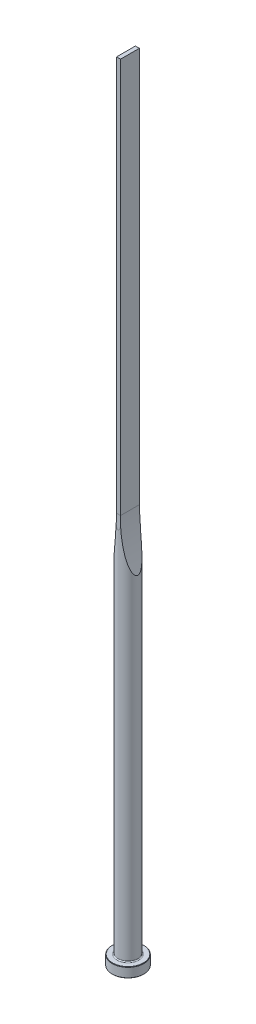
ISO-10303-21;
HEADER;
FILE_DESCRIPTION(('STEP AP214'),'2;1');
FILE_NAME('part.step','',(''),(''),'','','');
FILE_SCHEMA(('AUTOMOTIVE_DESIGN { 1 0 10303 214 1 1 1 1 }'));
ENDSEC;
DATA;
#1=APPLICATION_CONTEXT('core data for automotive mechanical design processes');
#2=APPLICATION_PROTOCOL_DEFINITION('international standard','automotive_design',2000,#1);
#3=PRODUCT_CONTEXT('',#1,'mechanical');
#4=PRODUCT('Part','Part','',(#3));
#5=PRODUCT_RELATED_PRODUCT_CATEGORY('part','',(#4));
#6=PRODUCT_DEFINITION_FORMATION('','',#4);
#7=PRODUCT_DEFINITION_CONTEXT('part definition',#1,'design');
#8=PRODUCT_DEFINITION('design','',#6,#7);
#9=PRODUCT_DEFINITION_SHAPE('','',#8);
#10=(LENGTH_UNIT() NAMED_UNIT(*) SI_UNIT(.MILLI.,.METRE.));
#11=(NAMED_UNIT(*) PLANE_ANGLE_UNIT() SI_UNIT($,.RADIAN.));
#12=(NAMED_UNIT(*) SI_UNIT($,.STERADIAN.) SOLID_ANGLE_UNIT());
#13=UNCERTAINTY_MEASURE_WITH_UNIT(LENGTH_MEASURE(1.E-05),#10,'distance_accuracy_value','');
#14=(GEOMETRIC_REPRESENTATION_CONTEXT(3) GLOBAL_UNCERTAINTY_ASSIGNED_CONTEXT((#13)) GLOBAL_UNIT_ASSIGNED_CONTEXT((#10,
#11,#12)) REPRESENTATION_CONTEXT('',''));
#15=CARTESIAN_POINT('',(0.,0.,0.));
#16=DIRECTION('',(0.,0.,1.));
#17=DIRECTION('',(1.,0.,0.));
#18=AXIS2_PLACEMENT_3D('',#15,#16,#17);
#19=CARTESIAN_POINT('',(0.,0.,0.));
#20=DIRECTION('',(0.,1.,0.));
#21=DIRECTION('',(-1.,0.,0.));
#22=AXIS2_PLACEMENT_3D('',#19,#20,#21);
#23=PLANE('',#22);
#24=CARTESIAN_POINT('',(0.,0.,0.));
#25=DIRECTION('',(0.,1.,0.));
#26=DIRECTION('',(-1.,0.,0.));
#27=AXIS2_PLACEMENT_3D('',#24,#25,#26);
#28=CIRCLE('',#27,7.8);
#29=CARTESIAN_POINT('',(-7.8,0.,0.));
#30=VERTEX_POINT('',#29);
#31=EDGE_CURVE('E133',#30,#30,#28,.T.);
#32=ORIENTED_EDGE('',*,*,#31,.F.);
#33=EDGE_LOOP('',(#32));
#34=FACE_BOUND('',#33,.T.);
#35=ADVANCED_FACE('F32',(#34),#23,.F.);
#36=CARTESIAN_POINT('',(0.,0.,0.));
#37=DIRECTION('',(0.,1.,0.));
#38=DIRECTION('',(-1.,0.,0.));
#39=AXIS2_PLACEMENT_3D('',#36,#37,#38);
#40=CONICAL_SURFACE('',#39,7.8,0.785398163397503);
#41=CARTESIAN_POINT('',(0.,0.199999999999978,0.));
#42=DIRECTION('',(0.,1.,0.));
#43=DIRECTION('',(-1.,0.,0.));
#44=AXIS2_PLACEMENT_3D('',#41,#42,#43);
#45=CIRCLE('',#44,8.);
#46=CARTESIAN_POINT('',(-8.,0.199999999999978,0.));
#47=VERTEX_POINT('',#46);
#48=EDGE_CURVE('E130',#47,#47,#45,.T.);
#49=ORIENTED_EDGE('',*,*,#48,.F.);
#50=EDGE_LOOP('',(#49));
#51=FACE_BOUND('',#50,.T.);
#52=ORIENTED_EDGE('',*,*,#31,.T.);
#53=EDGE_LOOP('',(#52));
#54=FACE_BOUND('',#53,.T.);
#55=ADVANCED_FACE('F171',(#51,#54),#40,.T.);
#56=CARTESIAN_POINT('',(0.,400.,0.));
#57=DIRECTION('',(0.,1.,0.));
#58=DIRECTION('',(-1.,0.,0.));
#59=AXIS2_PLACEMENT_3D('',#56,#57,#58);
#60=CYLINDRICAL_SURFACE('',#59,8.);
#61=CARTESIAN_POINT('',(0.,4.80000000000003,0.));
#62=DIRECTION('',(0.,1.,0.));
#63=DIRECTION('',(-1.,0.,0.));
#64=AXIS2_PLACEMENT_3D('',#61,#62,#63);
#65=CIRCLE('',#64,8.);
#66=CARTESIAN_POINT('',(-8.,4.80000000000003,0.));
#67=VERTEX_POINT('',#66);
#68=EDGE_CURVE('E127',#67,#67,#65,.T.);
#69=ORIENTED_EDGE('',*,*,#68,.F.);
#70=EDGE_LOOP('',(#69));
#71=FACE_BOUND('',#70,.T.);
#72=ORIENTED_EDGE('',*,*,#48,.T.);
#73=EDGE_LOOP('',(#72));
#74=FACE_BOUND('',#73,.T.);
#75=ADVANCED_FACE('F176',(#71,#74),#60,.T.);
#76=CARTESIAN_POINT('',(0.,4.80000000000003,0.));
#77=DIRECTION('',(0.,-1.,0.));
#78=DIRECTION('',(1.,0.,0.));
#79=AXIS2_PLACEMENT_3D('',#76,#77,#78);
#80=CONICAL_SURFACE('',#79,8.,0.785398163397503);
#81=CARTESIAN_POINT('',(0.,5.,0.));
#82=DIRECTION('',(0.,1.,0.));
#83=DIRECTION('',(-1.,0.,0.));
#84=AXIS2_PLACEMENT_3D('',#81,#82,#83);
#85=CIRCLE('',#84,7.8);
#86=CARTESIAN_POINT('',(-7.8,5.,0.));
#87=VERTEX_POINT('',#86);
#88=EDGE_CURVE('E124',#87,#87,#85,.T.);
#89=ORIENTED_EDGE('',*,*,#88,.F.);
#90=EDGE_LOOP('',(#89));
#91=FACE_BOUND('',#90,.T.);
#92=ORIENTED_EDGE('',*,*,#68,.T.);
#93=EDGE_LOOP('',(#92));
#94=FACE_BOUND('',#93,.T.);
#95=ADVANCED_FACE('F183',(#91,#94),#80,.T.);
#96=CARTESIAN_POINT('',(7.8,5.,0.));
#97=DIRECTION('',(0.,-1.,0.));
#98=DIRECTION('',(1.,0.,0.));
#99=AXIS2_PLACEMENT_3D('',#96,#97,#98);
#100=PLANE('',#99);
#101=CARTESIAN_POINT('',(0.,5.,0.));
#102=DIRECTION('',(0.,1.,0.));
#103=DIRECTION('',(-1.,0.,0.));
#104=AXIS2_PLACEMENT_3D('',#101,#102,#103);
#105=CIRCLE('',#104,5.50000000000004);
#106=CARTESIAN_POINT('',(-5.50000000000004,5.,0.));
#107=VERTEX_POINT('',#106);
#108=EDGE_CURVE('E121',#107,#107,#105,.T.);
#109=ORIENTED_EDGE('',*,*,#108,.F.);
#110=EDGE_LOOP('',(#109));
#111=FACE_BOUND('',#110,.T.);
#112=ORIENTED_EDGE('',*,*,#88,.T.);
#113=EDGE_LOOP('',(#112));
#114=FACE_BOUND('',#113,.T.);
#115=ADVANCED_FACE('F190',(#111,#114),#100,.F.);
#116=CARTESIAN_POINT('',(0.,5.5,0.));
#117=DIRECTION('',(0.,1.,0.));
#118=DIRECTION('',(-1.,0.,0.));
#119=AXIS2_PLACEMENT_3D('',#116,#117,#118);
#120=TOROIDAL_SURFACE('',#119,5.50000000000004,0.5);
#121=CARTESIAN_POINT('',(0.,5.50000000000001,0.));
#122=DIRECTION('',(0.,1.,0.));
#123=DIRECTION('',(-1.,0.,0.));
#124=AXIS2_PLACEMENT_3D('',#121,#122,#123);
#125=CIRCLE('',#124,5.00000000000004);
#126=CARTESIAN_POINT('',(-5.00000000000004,5.50000000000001,0.));
#127=VERTEX_POINT('',#126);
#128=EDGE_CURVE('E112',#127,#127,#125,.T.);
#129=ORIENTED_EDGE('',*,*,#128,.F.);
#130=EDGE_LOOP('',(#129));
#131=FACE_BOUND('',#130,.T.);
#132=ORIENTED_EDGE('',*,*,#108,.T.);
#133=EDGE_LOOP('',(#132));
#134=FACE_BOUND('',#133,.T.);
#135=ADVANCED_FACE('F168',(#131,#134),#120,.F.);
#136=CARTESIAN_POINT('',(0.,400.,0.));
#137=DIRECTION('',(0.,1.,0.));
#138=DIRECTION('',(-1.,0.,0.));
#139=AXIS2_PLACEMENT_3D('',#136,#137,#138);
#140=CYLINDRICAL_SURFACE('',#139,5.00000000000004);
#141=CARTESIAN_POINT('',(5.00000000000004,173.467001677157,0.));
#142=CARTESIAN_POINT('',(5.00000154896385,173.466996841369,0.0960044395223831));
#143=CARTESIAN_POINT('',(4.99720101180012,173.476068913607,0.191995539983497));
#144=CARTESIAN_POINT('',(4.98639433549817,173.511135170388,0.380563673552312));
#145=CARTESIAN_POINT('',(4.97838040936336,173.537154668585,0.473135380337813));
#146=CARTESIAN_POINT('',(4.95578653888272,173.610701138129,0.672615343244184));
#147=CARTESIAN_POINT('',(4.9401366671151,173.661744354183,0.778078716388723));
#148=CARTESIAN_POINT('',(4.90426575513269,173.77923907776,0.979118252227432));
#149=CARTESIAN_POINT('',(4.88403584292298,173.845720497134,1.07467469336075));
#150=CARTESIAN_POINT('',(4.84381261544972,173.978557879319,1.24247223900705));
#151=CARTESIAN_POINT('',(4.82425119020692,174.043395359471,1.31604909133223));
#152=CARTESIAN_POINT('',(4.7835319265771,174.1789689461,1.45712663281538));
#153=CARTESIAN_POINT('',(4.76237288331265,174.249709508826,1.52462265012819));
#154=CARTESIAN_POINT('',(4.71888736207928,174.395792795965,1.65432437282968));
#155=CARTESIAN_POINT('',(4.69655843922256,174.471145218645,1.71651822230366));
#156=CARTESIAN_POINT('',(4.65111253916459,174.62528630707,1.83609311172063));
#157=CARTESIAN_POINT('',(4.62799578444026,174.704074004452,1.89347549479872));
#158=CARTESIAN_POINT('',(4.5719364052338,174.896147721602,2.02594032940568));
#159=CARTESIAN_POINT('',(4.53873036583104,175.010731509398,2.09902518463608));
#160=CARTESIAN_POINT('',(4.47168855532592,175.243868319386,2.23829551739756));
#161=CARTESIAN_POINT('',(4.43785249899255,175.362423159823,2.30447777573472));
#162=CARTESIAN_POINT('',(4.36981519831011,175.602731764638,2.43102533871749));
#163=CARTESIAN_POINT('',(4.33561346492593,175.724490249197,2.49138136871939));
#164=CARTESIAN_POINT('',(4.26710841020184,175.970396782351,2.60696898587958));
#165=CARTESIAN_POINT('',(4.23280507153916,176.094545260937,2.66219964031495));
#166=CARTESIAN_POINT('',(4.12966776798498,176.471013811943,2.82170259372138));
#167=CARTESIAN_POINT('',(4.06092380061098,176.726238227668,2.91921456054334));
#168=CARTESIAN_POINT('',(3.95867524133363,177.112763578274,3.05484023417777));
#169=CARTESIAN_POINT('',(3.92475237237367,177.242159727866,3.09825753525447));
#170=CARTESIAN_POINT('',(3.85723820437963,177.502065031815,3.18191942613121));
#171=CARTESIAN_POINT('',(3.82364690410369,177.632574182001,3.22216402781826));
#172=CARTESIAN_POINT('',(3.73229791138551,177.990838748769,3.32834157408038));
#173=CARTESIAN_POINT('',(3.67493060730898,178.219544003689,3.39140657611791));
#174=CARTESIAN_POINT('',(3.5615703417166,178.679186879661,3.51026380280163));
#175=CARTESIAN_POINT('',(3.505577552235,178.910124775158,3.56605512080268));
#176=CARTESIAN_POINT('',(3.39509078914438,179.373882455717,3.67140136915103));
#177=CARTESIAN_POINT('',(3.34059749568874,179.606703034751,3.72095350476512));
#178=CARTESIAN_POINT('',(3.23323739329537,180.073815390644,3.81460850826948));
#179=CARTESIAN_POINT('',(3.18037067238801,180.308107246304,3.85871108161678));
#180=CARTESIAN_POINT('',(3.0241298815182,181.013725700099,3.98403896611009));
#181=CARTESIAN_POINT('',(2.92332782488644,181.486903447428,4.05808782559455));
#182=CARTESIAN_POINT('',(2.72899333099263,182.436841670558,4.19123126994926));
#183=CARTESIAN_POINT('',(2.63546167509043,182.913602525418,4.25032424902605));
#184=CARTESIAN_POINT('',(2.50068802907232,183.631393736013,4.33004331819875));
#185=CARTESIAN_POINT('',(2.45663062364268,183.871411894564,4.3551563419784));
#186=CARTESIAN_POINT('',(2.37042835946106,184.352040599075,4.40266882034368));
#187=CARTESIAN_POINT('',(2.32828335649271,184.592651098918,4.42506847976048));
#188=CARTESIAN_POINT('',(2.2047335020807,185.315329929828,4.48862457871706));
#189=CARTESIAN_POINT('',(2.1262190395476,185.798217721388,4.52613511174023));
#190=CARTESIAN_POINT('',(1.97709022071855,186.765174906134,4.593231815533));
#191=CARTESIAN_POINT('',(1.9064669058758,187.249242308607,4.62282702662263));
#192=CARTESIAN_POINT('',(1.7730815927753,188.218807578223,4.67560955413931));
#193=CARTESIAN_POINT('',(1.71031965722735,188.704305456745,4.6987968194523));
#194=CARTESIAN_POINT('',(1.59289942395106,189.674859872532,4.7398865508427));
#195=CARTESIAN_POINT('',(1.53821490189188,190.159912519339,4.75780631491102));
#196=CARTESIAN_POINT('',(1.43673211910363,191.130987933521,4.78942837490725));
#197=CARTESIAN_POINT('',(1.38993403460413,191.617010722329,4.80313057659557));
#198=CARTESIAN_POINT('',(1.30424463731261,192.589875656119,4.82710313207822));
#199=CARTESIAN_POINT('',(1.26535396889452,193.076717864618,4.83737320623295));
#200=CARTESIAN_POINT('',(1.19549959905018,194.05102909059,4.8551084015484));
#201=CARTESIAN_POINT('',(1.16453604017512,194.538498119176,4.86257347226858));
#202=CARTESIAN_POINT('',(1.11052476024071,195.514329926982,4.87519312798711));
#203=CARTESIAN_POINT('',(1.08748394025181,196.002693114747,4.88034569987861));
#204=CARTESIAN_POINT('',(1.04936282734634,196.979749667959,4.88868116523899));
#205=CARTESIAN_POINT('',(1.03428266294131,197.468443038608,4.89186402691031));
#206=CARTESIAN_POINT('',(1.00099348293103,198.934743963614,4.89884013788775));
#207=CARTESIAN_POINT('',(0.994730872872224,199.912661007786,4.90006195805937));
#208=CARTESIAN_POINT('',(1.01403027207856,201.863278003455,4.89610457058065));
#209=CARTESIAN_POINT('',(1.03943328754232,202.835979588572,4.89095734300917));
#210=CARTESIAN_POINT('',(1.10117659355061,204.293976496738,4.87727389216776));
#211=CARTESIAN_POINT('',(1.12569941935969,204.779825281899,4.87171852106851));
#212=CARTESIAN_POINT('',(1.18261689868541,205.751025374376,4.85821856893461));
#213=CARTESIAN_POINT('',(1.21501141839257,206.236376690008,4.85027402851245));
#214=CARTESIAN_POINT('',(1.28763203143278,207.206055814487,4.83150141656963));
#215=CARTESIAN_POINT('',(1.32785199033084,207.690384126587,4.82067560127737));
#216=CARTESIAN_POINT('',(1.41612183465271,208.65822682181,4.79548827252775));
#217=CARTESIAN_POINT('',(1.46417155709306,209.141741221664,4.78112683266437));
#218=CARTESIAN_POINT('',(1.56807107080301,210.107721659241,4.7480654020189));
#219=CARTESIAN_POINT('',(1.62391986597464,210.590187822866,4.72936596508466));
#220=CARTESIAN_POINT('',(1.74338740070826,211.553910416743,4.68664389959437));
#221=CARTESIAN_POINT('',(1.80700584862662,212.03516689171,4.66262147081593));
#222=CARTESIAN_POINT('',(1.91158138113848,212.779860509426,4.62033026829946));
#223=CARTESIAN_POINT('',(1.94984472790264,213.043808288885,4.60434084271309));
#224=CARTESIAN_POINT('',(2.02869323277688,213.571207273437,4.57014746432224));
#225=CARTESIAN_POINT('',(2.06927834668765,213.834658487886,4.55194355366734));
#226=CARTESIAN_POINT('',(2.19451193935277,214.624272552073,4.49362155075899));
#227=CARTESIAN_POINT('',(2.28262885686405,215.149625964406,4.44979702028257));
#228=CARTESIAN_POINT('',(2.46855242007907,216.200912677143,4.34942322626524));
#229=CARTESIAN_POINT('',(2.56641761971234,216.726828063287,4.29279410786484));
#230=CARTESIAN_POINT('',(2.77107152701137,217.7747263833,4.16363596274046));
#231=CARTESIAN_POINT('',(2.8778553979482,218.296711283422,4.09111551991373));
#232=CARTESIAN_POINT('',(3.04514240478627,219.079188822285,3.96635668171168));
#233=CARTESIAN_POINT('',(3.10247530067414,219.341587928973,3.9217738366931));
#234=CARTESIAN_POINT('',(3.21924275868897,219.864805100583,3.82650860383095));
#235=CARTESIAN_POINT('',(3.27867723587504,220.125623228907,3.77582646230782));
#236=CARTESIAN_POINT('',(3.39967776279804,220.645945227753,3.66726258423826));
#237=CARTESIAN_POINT('',(3.46124851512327,220.905444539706,3.60936412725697));
#238=CARTESIAN_POINT('',(3.5862174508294,221.421979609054,3.48522701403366));
#239=CARTESIAN_POINT('',(3.64961542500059,221.679015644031,3.41898930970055));
#240=CARTESIAN_POINT('',(3.77749515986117,222.187899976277,3.27713111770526));
#241=CARTESIAN_POINT('',(3.84196420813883,222.43977331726,3.20158985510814));
#242=CARTESIAN_POINT('',(3.97210146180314,222.93929985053,3.03863271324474));
#243=CARTESIAN_POINT('',(4.03776939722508,223.186953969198,2.95121947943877));
#244=CARTESIAN_POINT('',(4.16951934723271,223.675541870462,2.76195924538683));
#245=CARTESIAN_POINT('',(4.23559878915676,223.916497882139,2.66016919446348));
#246=CARTESIAN_POINT('',(4.33442118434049,224.27122894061,2.49337583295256));
#247=CARTESIAN_POINT('',(4.36729744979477,224.388303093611,2.43545657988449));
#248=CARTESIAN_POINT('',(4.43276290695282,224.619664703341,2.314168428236));
#249=CARTESIAN_POINT('',(4.46535216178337,224.733952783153,2.25080076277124));
#250=CARTESIAN_POINT('',(4.5275984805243,224.950662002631,2.12262681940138));
#251=CARTESIAN_POINT('',(4.55729460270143,225.053336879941,2.05827093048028));
#252=CARTESIAN_POINT('',(4.61592874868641,225.254766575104,1.92318274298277));
#253=CARTESIAN_POINT('',(4.64486628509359,225.353518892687,1.85244646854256));
#254=CARTESIAN_POINT('',(4.70136067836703,225.545151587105,1.70396207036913));
#255=CARTESIAN_POINT('',(4.7289243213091,225.63806157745,1.62625514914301));
#256=CARTESIAN_POINT('',(4.78216227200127,225.816527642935,1.46230953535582));
#257=CARTESIAN_POINT('',(4.80783889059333,225.902092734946,1.3760815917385));
#258=CARTESIAN_POINT('',(4.85290402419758,226.051546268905,1.20659680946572));
#259=CARTESIAN_POINT('',(4.87266804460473,226.116788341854,1.12464947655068));
#260=CARTESIAN_POINT('',(4.90919794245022,226.236953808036,0.952631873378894));
#261=CARTESIAN_POINT('',(4.92596117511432,226.291868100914,0.862554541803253));
#262=CARTESIAN_POINT('',(4.95542941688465,226.388149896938,0.673062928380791));
#263=CARTESIAN_POINT('',(4.96807762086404,226.429327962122,0.573540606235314));
#264=CARTESIAN_POINT('',(4.98749102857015,226.492441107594,0.368082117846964));
#265=CARTESIAN_POINT('',(4.99427223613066,226.514428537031,0.262164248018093));
#266=CARTESIAN_POINT('',(5.00054554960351,226.534768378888,0.0599572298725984));
#267=CARTESIAN_POINT('',(5.0007754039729,226.535512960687,-0.0360658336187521));
#268=CARTESIAN_POINT('',(4.9957774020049,226.519309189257,-0.226483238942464));
#269=CARTESIAN_POINT('',(4.99054546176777,226.502347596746,-0.320876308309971));
#270=CARTESIAN_POINT('',(4.97457918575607,226.450477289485,-0.513611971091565));
#271=CARTESIAN_POINT('',(4.96337346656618,226.414030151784,-0.611490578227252));
#272=CARTESIAN_POINT('',(4.93654473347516,226.326484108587,-0.799757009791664));
#273=CARTESIAN_POINT('',(4.92091437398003,226.275360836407,-0.890132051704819));
#274=CARTESIAN_POINT('',(4.87641895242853,226.129244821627,-1.11360480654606));
#275=CARTESIAN_POINT('',(4.84515754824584,226.026074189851,-1.24080589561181));
#276=CARTESIAN_POINT('',(4.7781095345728,225.803086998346,-1.47815178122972));
#277=CARTESIAN_POINT('',(4.74231048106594,225.683224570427,-1.58824774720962));
#278=CARTESIAN_POINT('',(4.66694126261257,225.428746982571,-1.79789942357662));
#279=CARTESIAN_POINT('',(4.62728518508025,225.293773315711,-1.89698164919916));
#280=CARTESIAN_POINT('',(4.54647688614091,225.016180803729,-2.08323058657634));
#281=CARTESIAN_POINT('',(4.50532306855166,224.873553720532,-2.17038408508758));
#282=CARTESIAN_POINT('',(4.42221036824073,224.582702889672,-2.33507335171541));
#283=CARTESIAN_POINT('',(4.3802499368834,224.434467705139,-2.41258791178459));
#284=CARTESIAN_POINT('',(4.29610542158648,224.134186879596,-2.55941949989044));
#285=CARTESIAN_POINT('',(4.25392145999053,223.982143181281,-2.62874060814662));
#286=CARTESIAN_POINT('',(4.17555386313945,223.696714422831,-2.75122865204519));
#287=CARTESIAN_POINT('',(4.1393612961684,223.563714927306,-2.80529603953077));
#288=CARTESIAN_POINT('',(4.06716125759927,223.295939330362,-2.9089832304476));
#289=CARTESIAN_POINT('',(4.03115380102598,223.161163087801,-2.95860267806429));
#290=CARTESIAN_POINT('',(3.92354173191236,222.754537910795,-3.10163136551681));
#291=CARTESIAN_POINT('',(3.85237701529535,222.480500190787,-3.18916589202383));
#292=CARTESIAN_POINT('',(3.71167581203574,221.927836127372,-3.35186649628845));
#293=CARTESIAN_POINT('',(3.64214267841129,221.64920205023,-3.42700874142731));
#294=CARTESIAN_POINT('',(3.50517413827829,221.088827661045,-3.56697884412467));
#295=CARTESIAN_POINT('',(3.43773897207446,220.807086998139,-3.6318055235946));
#296=CARTESIAN_POINT('',(3.30484385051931,220.239687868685,-3.75315060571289));
#297=CARTESIAN_POINT('',(3.23939665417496,219.954016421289,-3.80962183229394));
#298=CARTESIAN_POINT('',(3.11101855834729,219.380743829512,-3.91515820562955));
#299=CARTESIAN_POINT('',(3.04808776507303,219.093142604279,-3.96422304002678));
#300=CARTESIAN_POINT('',(2.92493217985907,218.516727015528,-4.05594109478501));
#301=CARTESIAN_POINT('',(2.86470416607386,218.227914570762,-4.09860209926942));
#302=CARTESIAN_POINT('',(2.74695256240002,217.648991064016,-4.17843292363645));
#303=CARTESIAN_POINT('',(2.68942895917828,217.358880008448,-4.21560277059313));
#304=CARTESIAN_POINT('',(2.53355818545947,216.551892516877,-4.31217985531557));
#305=CARTESIAN_POINT('',(2.43818802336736,216.033821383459,-4.3664482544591));
#306=CARTESIAN_POINT('',(2.25638863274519,214.994985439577,-4.46310156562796));
#307=CARTESIAN_POINT('',(2.16996035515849,214.47422034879,-4.5054852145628));
#308=CARTESIAN_POINT('',(2.00615726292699,213.430382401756,-4.58077043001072));
#309=CARTESIAN_POINT('',(1.92878603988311,212.90730871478,-4.61366824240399));
#310=CARTESIAN_POINT('',(1.78322876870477,211.85949035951,-4.67185522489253));
#311=CARTESIAN_POINT('',(1.71504240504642,211.334745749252,-4.69714465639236));
#312=CARTESIAN_POINT('',(1.58778759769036,210.282872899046,-4.74167486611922));
#313=CARTESIAN_POINT('',(1.52873698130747,209.755742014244,-4.76090389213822));
#314=CARTESIAN_POINT('',(1.41995149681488,208.700363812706,-4.79447345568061));
#315=CARTESIAN_POINT('',(1.37021670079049,208.172116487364,-4.80881395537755));
#316=CARTESIAN_POINT('',(1.28009974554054,207.114839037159,-4.83358319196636));
#317=CARTESIAN_POINT('',(1.23971576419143,206.585809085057,-4.84401269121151));
#318=CARTESIAN_POINT('',(1.16830723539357,205.527068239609,-4.86172917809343));
#319=CARTESIAN_POINT('',(1.137282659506,204.997357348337,-4.8690161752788));
#320=CARTESIAN_POINT('',(1.0846698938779,203.938730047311,-4.88100571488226));
#321=CARTESIAN_POINT('',(1.06305894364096,203.409814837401,-4.88571449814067));
#322=CARTESIAN_POINT('',(1.02917222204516,202.351670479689,-4.89296479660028));
#323=CARTESIAN_POINT('',(1.01689645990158,201.822441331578,-4.89550630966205));
#324=CARTESIAN_POINT('',(1.00168410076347,200.763802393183,-4.89864156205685));
#325=CARTESIAN_POINT('',(0.998748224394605,200.234392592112,-4.89923515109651));
#326=CARTESIAN_POINT('',(1.00221872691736,199.175606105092,-4.89852639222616));
#327=CARTESIAN_POINT('',(1.00862508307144,198.646229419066,-4.89722404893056));
#328=CARTESIAN_POINT('',(1.03076533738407,197.588269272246,-4.89261183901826));
#329=CARTESIAN_POINT('',(1.04648884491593,197.059685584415,-4.88930420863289));
#330=CARTESIAN_POINT('',(1.08724906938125,196.002896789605,-4.88040215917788));
#331=CARTESIAN_POINT('',(1.11228577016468,195.474691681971,-4.87480774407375));
#332=CARTESIAN_POINT('',(1.17165876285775,194.418904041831,-4.8608790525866));
#333=CARTESIAN_POINT('',(1.20599394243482,193.891321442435,-4.8525451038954));
#334=CARTESIAN_POINT('',(1.28394960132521,192.836917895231,-4.83250425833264));
#335=CARTESIAN_POINT('',(1.32756979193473,192.310096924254,-4.8207974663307));
#336=CARTESIAN_POINT('',(1.39938046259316,191.526772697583,-4.80024265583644));
#337=CARTESIAN_POINT('',(1.42404381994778,191.269899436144,-4.79299742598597));
#338=CARTESIAN_POINT('',(1.47557483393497,190.756414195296,-4.7773845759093));
#339=CARTESIAN_POINT('',(1.50244244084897,190.499802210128,-4.76901698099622));
#340=CARTESIAN_POINT('',(1.58634730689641,189.730387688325,-4.74204261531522));
#341=CARTESIAN_POINT('',(1.64668680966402,189.218004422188,-4.72156420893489));
#342=CARTESIAN_POINT('',(1.77608600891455,188.194965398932,-4.67442569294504));
#343=CARTESIAN_POINT('',(1.84513998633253,187.684308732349,-4.64776962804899));
#344=CARTESIAN_POINT('',(1.99193759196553,186.664705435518,-4.58677614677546));
#345=CARTESIAN_POINT('',(2.06968099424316,186.155758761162,-4.55243893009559));
#346=CARTESIAN_POINT('',(2.20798798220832,185.299554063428,-4.48649769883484));
#347=CARTESIAN_POINT('',(2.26627559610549,184.95173209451,-4.45742409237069));
#348=CARTESIAN_POINT('',(2.38684958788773,184.257262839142,-4.39404053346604));
#349=CARTESIAN_POINT('',(2.44913588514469,183.910615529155,-4.35973068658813));
#350=CARTESIAN_POINT('',(2.57765345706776,183.218687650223,-4.28500117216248));
#351=CARTESIAN_POINT('',(2.64388492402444,182.873407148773,-4.244581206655));
#352=CARTESIAN_POINT('',(2.78020235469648,182.184540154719,-4.15656616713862));
#353=CARTESIAN_POINT('',(2.85028819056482,181.840953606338,-4.10897133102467));
#354=CARTESIAN_POINT('',(3.02204202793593,181.023320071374,-3.98528420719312));
#355=CARTESIAN_POINT('',(3.12544238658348,180.550203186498,-3.90528915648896));
#356=CARTESIAN_POINT('',(3.2855695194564,179.844680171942,-3.76959949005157));
#357=CARTESIAN_POINT('',(3.33978638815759,179.610183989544,-3.72175008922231));
#358=CARTESIAN_POINT('',(3.44979842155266,179.14287177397,-3.6200165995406));
#359=CARTESIAN_POINT('',(3.50559354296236,178.910055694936,-3.56613267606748));
#360=CARTESIAN_POINT('',(3.61627256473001,178.456173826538,-3.45377007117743));
#361=CARTESIAN_POINT('',(3.67109727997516,178.23502322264,-3.39557708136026));
#362=CARTESIAN_POINT('',(3.78191185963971,177.7951236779,-3.27170533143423));
#363=CARTESIAN_POINT('',(3.83790164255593,177.576374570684,-3.20602709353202));
#364=CARTESIAN_POINT('',(3.95085857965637,177.141797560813,-3.0657520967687));
#365=CARTESIAN_POINT('',(4.00782644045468,176.925971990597,-2.99114863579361));
#366=CARTESIAN_POINT('',(4.12234036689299,176.498486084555,-2.83125530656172));
#367=CARTESIAN_POINT('',(4.17988625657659,176.28682453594,-2.74596860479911));
#368=CARTESIAN_POINT('',(4.27415528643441,175.944918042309,-2.59544961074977));
#369=CARTESIAN_POINT('',(4.31087254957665,175.812946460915,-2.53413927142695));
#370=CARTESIAN_POINT('',(4.38408949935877,175.552047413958,-2.40525694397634));
#371=CARTESIAN_POINT('',(4.42058923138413,175.423119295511,-2.33768631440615));
#372=CARTESIAN_POINT('',(4.4929997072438,175.16944901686,-2.19529639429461));
#373=CARTESIAN_POINT('',(4.52891139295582,175.044699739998,-2.12049036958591));
#374=CARTESIAN_POINT('',(4.59972657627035,174.800617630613,-1.96215201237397));
#375=CARTESIAN_POINT('',(4.63463070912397,174.681281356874,-1.87862533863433));
#376=CARTESIAN_POINT('',(4.70230429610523,174.451578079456,-1.70210724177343));
#377=CARTESIAN_POINT('',(4.73509500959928,174.341117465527,-1.60924745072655));
#378=CARTESIAN_POINT('',(4.79790106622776,174.130904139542,-1.41101509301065));
#379=CARTESIAN_POINT('',(4.82791715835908,174.031148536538,-1.30564592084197));
#380=CARTESIAN_POINT('',(4.87770376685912,173.866574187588,-1.10298058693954));
#381=CARTESIAN_POINT('',(4.89831887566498,173.798769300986,-1.00835750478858));
#382=CARTESIAN_POINT('',(4.93513150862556,173.678100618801,-0.809128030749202));
#383=CARTESIAN_POINT('',(4.95133579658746,173.625213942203,-0.70453726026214));
#384=CARTESIAN_POINT('',(4.97573891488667,173.545737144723,-0.501038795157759));
#385=CARTESIAN_POINT('',(4.98472133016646,173.516566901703,-0.403258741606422));
#386=CARTESIAN_POINT('',(4.99684527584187,173.477220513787,-0.203641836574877));
#387=CARTESIAN_POINT('',(4.99999835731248,173.467006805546,-0.101813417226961));
#388=CARTESIAN_POINT('',(5.00000000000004,173.467001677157,0.));
#389=B_SPLINE_CURVE_WITH_KNOTS('',3,(#141,#142,#143,#144,#145,#146,#147,#148,#149,#150,#151,
#152,#153,#154,#155,#156,#157,#158,#159,#160,#161,#162,#163,#164,#165,#166,#167,#168,#169,#170,
#171,#172,#173,#174,#175,#176,#177,#178,#179,#180,#181,#182,#183,#184,#185,#186,#187,#188,#189,
#190,#191,#192,#193,#194,#195,#196,#197,#198,#199,#200,#201,#202,#203,#204,#205,#206,#207,#208,
#209,#210,#211,#212,#213,#214,#215,#216,#217,#218,#219,#220,#221,#222,#223,#224,#225,#226,#227,
#228,#229,#230,#231,#232,#233,#234,#235,#236,#237,#238,#239,#240,#241,#242,#243,#244,#245,#246,
#247,#248,#249,#250,#251,#252,#253,#254,#255,#256,#257,#258,#259,#260,#261,#262,#263,#264,#265,
#266,#267,#268,#269,#270,#271,#272,#273,#274,#275,#276,#277,#278,#279,#280,#281,#282,#283,#284,
#285,#286,#287,#288,#289,#290,#291,#292,#293,#294,#295,#296,#297,#298,#299,#300,#301,#302,#303,
#304,#305,#306,#307,#308,#309,#310,#311,#312,#313,#314,#315,#316,#317,#318,#319,#320,#321,#322,
#323,#324,#325,#326,#327,#328,#329,#330,#331,#332,#333,#334,#335,#336,#337,#338,#339,#340,#341,
#342,#343,#344,#345,#346,#347,#348,#349,#350,#351,#352,#353,#354,#355,#356,#357,#358,#359,#360,
#361,#362,#363,#364,#365,#366,#367,#368,#369,#370,#371,#372,#373,#374,#375,#376,#377,#378,#379,
#380,#381,#382,#383,#384,#385,#386,#387,#388),.UNSPECIFIED.,.T.,.F.,(4,2,2,2,2,2,2,2,2,2,2,2,2,
2,2,2,2,2,2,2,2,2,2,2,2,2,2,2,2,2,2,2,2,2,2,2,2,2,2,2,2,2,2,2,2,2,2,2,2,2,2,2,2,2,2,2,2,2,2,2,2,
2,2,2,2,2,2,2,2,2,2,2,2,2,2,2,2,2,2,2,2,2,2,2,2,2,2,2,2,2,2,2,2,2,2,2,2,2,2,2,2,2,2,2,2,2,2,2,2,
2,2,2,2,2,2,2,2,2,2,2,2,2,2,4),(0.,0.287558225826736,0.575546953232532,0.928165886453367,
1.28147381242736,1.58105140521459,1.88085723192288,2.18131675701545,2.48169212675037,
2.90110645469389,3.32071552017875,3.74098190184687,4.16132461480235,5.00588787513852,
5.42778120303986,5.84967295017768,6.58175259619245,7.31392340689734,8.0464210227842,
8.77895821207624,10.2468428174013,11.7148849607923,12.450815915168,13.1866912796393,
14.6585275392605,16.1286755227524,17.5988352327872,19.0641117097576,20.5294209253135,
21.9948495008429,23.460304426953,24.9270326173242,26.3937844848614,29.3270218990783,
32.2455906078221,33.7050297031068,35.1644439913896,36.6227188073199,38.0809632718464,
39.5390216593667,40.9970253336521,41.7985644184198,42.6000882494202,44.2033477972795,
45.8168961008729,47.429574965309,48.2463041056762,49.0630002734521,49.8816252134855,
50.7001567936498,51.5121461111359,52.3239547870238,53.1326335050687,53.5366009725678,
53.9404772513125,54.3145814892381,54.6889204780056,55.0611767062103,55.4329692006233,
55.7520934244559,56.0714975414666,56.3951401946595,56.7178972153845,57.0041451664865,
57.2906073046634,57.6040214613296,57.9179590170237,58.4153545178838,58.9141448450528,
59.4295563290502,59.9455341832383,60.4626279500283,60.9794631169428,61.4235602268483,
61.8676928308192,62.7563186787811,63.6466340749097,64.5370510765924,65.4323179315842,
66.3276225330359,67.2218298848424,68.1160328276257,69.704446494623,71.293028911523,
72.8822391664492,74.4713948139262,76.0636134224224,77.655844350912,79.2477647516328,
80.8396803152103,82.4277252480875,84.015771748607,85.6039407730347,87.1921059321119,
88.7785032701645,90.3648978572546,91.951102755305,93.5372583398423,94.31171672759,
95.0861576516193,96.6350329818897,98.1828970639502,99.7307209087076,100.792271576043,
101.853800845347,102.915381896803,103.976927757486,105.448975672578,106.185087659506,
106.921179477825,107.626544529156,108.331860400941,109.037709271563,109.74334942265,
110.193457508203,110.643468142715,111.092668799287,111.541579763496,111.984868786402,
112.428037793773,112.78163087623,113.134678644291,113.440242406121,113.745200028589),.UNSPECIFIED.);
#390=CARTESIAN_POINT('',(1.12239470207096,195.307871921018,-4.87239470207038));
#391=VERTEX_POINT('',#390);
#392=CARTESIAN_POINT('',(1.12239470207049,195.307871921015,4.87239470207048));
#393=VERTEX_POINT('',#392);
#394=EDGE_CURVE('E138',#391,#393,#389,.T.);
#395=ORIENTED_EDGE('',*,*,#394,.T.);
#396=CARTESIAN_POINT('',(-1.56124949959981,200.,4.74999999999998));
#397=CARTESIAN_POINT('',(-1.56124909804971,200.280275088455,4.74999999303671));
#398=CARTESIAN_POINT('',(-1.55728190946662,200.560549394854,4.75130959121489));
#399=CARTESIAN_POINT('',(-1.5412223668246,201.120839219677,4.75654354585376));
#400=CARTESIAN_POINT('',(-1.5291301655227,201.400854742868,4.76046785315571));
#401=CARTESIAN_POINT('',(-1.49622334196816,201.960158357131,4.77091379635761));
#402=CARTESIAN_POINT('',(-1.47541419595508,202.239446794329,4.77743380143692));
#403=CARTESIAN_POINT('',(-1.42390023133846,202.796993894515,4.79304036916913));
#404=CARTESIAN_POINT('',(-1.3931974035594,203.075252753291,4.80212641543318));
#405=CARTESIAN_POINT('',(-1.32163854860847,203.616514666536,4.82230425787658));
#406=CARTESIAN_POINT('',(-1.28135596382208,203.879595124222,4.83327546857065));
#407=CARTESIAN_POINT('',(-1.21025315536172,204.272594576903,4.85137807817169));
#408=CARTESIAN_POINT('',(-1.18472794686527,204.40351136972,4.85769686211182));
#409=CARTESIAN_POINT('',(-1.12941406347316,204.664393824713,4.87085630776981));
#410=CARTESIAN_POINT('',(-1.09962649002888,204.79435972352,4.87769683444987));
#411=CARTESIAN_POINT('',(-1.04028074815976,205.030993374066,4.89066177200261));
#412=CARTESIAN_POINT('',(-1.01154252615,205.137869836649,4.89671054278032));
#413=CARTESIAN_POINT('',(-0.949556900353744,205.350283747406,4.90910859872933));
#414=CARTESIAN_POINT('',(-0.91631063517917,205.45582152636,4.91545780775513));
#415=CARTESIAN_POINT('',(-0.844084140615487,205.664473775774,4.92837326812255));
#416=CARTESIAN_POINT('',(-0.80512588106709,205.767595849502,4.93493861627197));
#417=CARTESIAN_POINT('',(-0.719242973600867,205.970408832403,4.94819344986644));
#418=CARTESIAN_POINT('',(-0.672333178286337,206.070105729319,4.95488268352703));
#419=CARTESIAN_POINT('',(-0.590193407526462,206.219314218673,4.96512953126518));
#420=CARTESIAN_POINT('',(-0.559251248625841,206.271162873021,4.96873759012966));
#421=CARTESIAN_POINT('',(-0.492379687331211,206.371634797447,4.97581229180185));
#422=CARTESIAN_POINT('',(-0.456453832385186,206.420260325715,4.97927903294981));
#423=CARTESIAN_POINT('',(-0.392115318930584,206.495011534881,4.98466324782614));
#424=CARTESIAN_POINT('',(-0.365747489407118,206.522870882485,4.98668429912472));
#425=CARTESIAN_POINT('',(-0.309588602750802,206.57497277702,4.99048569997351));
#426=CARTESIAN_POINT('',(-0.279803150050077,206.599221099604,4.99226643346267));
#427=CARTESIAN_POINT('',(-0.226668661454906,206.634995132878,4.99490514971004));
#428=CARTESIAN_POINT('',(-0.204394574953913,206.648089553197,4.99587455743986));
#429=CARTESIAN_POINT('',(-0.158090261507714,206.670718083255,4.99755352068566));
#430=CARTESIAN_POINT('',(-0.134063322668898,206.680258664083,4.99826354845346));
#431=CARTESIAN_POINT('',(-0.0886514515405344,206.693589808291,4.9992568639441));
#432=CARTESIAN_POINT('',(-0.0674708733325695,206.698062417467,4.99959071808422));
#433=CARTESIAN_POINT('',(-0.0246551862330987,206.703342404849,4.99998491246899));
#434=CARTESIAN_POINT('',(-0.00302040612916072,206.704152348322,5.00004544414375));
#435=CARTESIAN_POINT('',(0.0400515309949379,206.702017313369,4.99988599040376));
#436=CARTESIAN_POINT('',(0.0614887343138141,206.699073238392,4.99966607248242));
#437=CARTESIAN_POINT('',(0.103598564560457,206.689756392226,4.99897114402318));
#438=CARTESIAN_POINT('',(0.124270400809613,206.683380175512,4.99849587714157));
#439=CARTESIAN_POINT('',(0.172649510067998,206.664591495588,4.9970984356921));
#440=CARTESIAN_POINT('',(0.19980487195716,206.650779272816,4.99607315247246));
#441=CARTESIAN_POINT('',(0.251622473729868,206.619113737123,4.99373231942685));
#442=CARTESIAN_POINT('',(0.276277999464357,206.601249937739,4.99241601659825));
#443=CARTESIAN_POINT('',(0.342266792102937,206.547223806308,4.98845446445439));
#444=CARTESIAN_POINT('',(0.380989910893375,206.507933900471,4.98559441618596));
#445=CARTESIAN_POINT('',(0.45275953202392,206.424556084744,4.9795880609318));
#446=CARTESIAN_POINT('',(0.485787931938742,206.380453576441,4.97644088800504));
#447=CARTESIAN_POINT('',(0.565503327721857,206.263121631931,4.9681618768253));
#448=CARTESIAN_POINT('',(0.609051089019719,206.187790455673,4.96293429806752));
#449=CARTESIAN_POINT('',(0.689220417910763,206.033476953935,4.95243210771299));
#450=CARTESIAN_POINT('',(0.725825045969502,205.954486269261,4.9471574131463));
#451=CARTESIAN_POINT('',(0.794127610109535,205.793921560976,4.93665480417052));
#452=CARTESIAN_POINT('',(0.825798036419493,205.712335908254,4.93142729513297));
#453=CARTESIAN_POINT('',(0.885154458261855,205.547854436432,4.92111763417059));
#454=CARTESIAN_POINT('',(0.912845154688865,205.464960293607,4.91603531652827));
#455=CARTESIAN_POINT('',(0.991561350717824,205.213800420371,4.90099061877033));
#456=CARTESIAN_POINT('',(1.03784195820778,205.044035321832,4.89129471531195));
#457=CARTESIAN_POINT('',(1.12160376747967,204.702272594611,4.87276151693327));
#458=CARTESIAN_POINT('',(1.15907938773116,204.530273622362,4.86392476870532));
#459=CARTESIAN_POINT('',(1.22728467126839,204.184529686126,4.84716510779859));
#460=CARTESIAN_POINT('',(1.25799984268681,204.01078179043,4.83924417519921));
#461=CARTESIAN_POINT('',(1.31385289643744,203.662342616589,4.8243769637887));
#462=CARTESIAN_POINT('',(1.33899000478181,203.487651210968,4.81743082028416));
#463=CARTESIAN_POINT('',(1.40734156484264,202.962576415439,4.79809189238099));
#464=CARTESIAN_POINT('',(1.44349272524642,202.611211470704,4.78719953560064));
#465=CARTESIAN_POINT('',(1.50080391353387,201.9076523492,4.76953198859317));
#466=CARTESIAN_POINT('',(1.52198194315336,201.555459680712,4.7627518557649));
#467=CARTESIAN_POINT('',(1.55100340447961,200.854340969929,4.75337976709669));
#468=CARTESIAN_POINT('',(1.55899037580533,200.505421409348,4.75074274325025));
#469=CARTESIAN_POINT('',(1.56268162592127,199.807374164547,4.74952903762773));
#470=CARTESIAN_POINT('',(1.55838094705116,199.45824645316,4.75095399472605));
#471=CARTESIAN_POINT('',(1.53718974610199,198.761012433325,4.7578546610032));
#472=CARTESIAN_POINT('',(1.52032131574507,198.412905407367,4.76332326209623));
#473=CARTESIAN_POINT('',(1.4726759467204,197.717832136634,4.77826818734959));
#474=CARTESIAN_POINT('',(1.44190352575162,197.370865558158,4.78774320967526));
#475=CARTESIAN_POINT('',(1.36365394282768,196.678826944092,4.81063411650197));
#476=CARTESIAN_POINT('',(1.31617630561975,196.333754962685,4.82405011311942));
#477=CARTESIAN_POINT('',(1.2278246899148,195.819245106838,4.84699228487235));
#478=CARTESIAN_POINT('',(1.19552315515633,195.648278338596,4.85510823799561));
#479=CARTESIAN_POINT('',(1.12372438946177,195.307953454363,4.87222905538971));
#480=CARTESIAN_POINT('',(1.08422969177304,195.138594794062,4.88123360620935));
#481=CARTESIAN_POINT('',(0.995702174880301,194.802088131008,4.9000691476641));
#482=CARTESIAN_POINT('',(0.946657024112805,194.634943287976,4.90990119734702));
#483=CARTESIAN_POINT('',(0.862537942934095,194.387690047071,4.92512126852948));
#484=CARTESIAN_POINT('',(0.83271293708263,194.30578856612,4.93027740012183));
#485=CARTESIAN_POINT('',(0.768517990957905,194.14380983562,4.94069314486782));
#486=CARTESIAN_POINT('',(0.734151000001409,194.063731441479,4.94595268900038));
#487=CARTESIAN_POINT('',(0.65907479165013,193.905998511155,4.95651780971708));
#488=CARTESIAN_POINT('',(0.618328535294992,193.828361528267,4.9618234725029));
#489=CARTESIAN_POINT('',(0.528037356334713,193.678498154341,4.97225145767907));
#490=CARTESIAN_POINT('',(0.478541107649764,193.606244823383,4.9773746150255));
#491=CARTESIAN_POINT('',(0.401827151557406,193.516022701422,4.98386702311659));
#492=CARTESIAN_POINT('',(0.380686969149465,193.492964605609,4.98553608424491));
#493=CARTESIAN_POINT('',(0.33618408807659,193.448977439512,4.98873561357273));
#494=CARTESIAN_POINT('',(0.312817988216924,193.428051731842,4.9902658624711));
#495=CARTESIAN_POINT('',(0.263265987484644,193.389093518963,4.99312671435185));
#496=CARTESIAN_POINT('',(0.23704965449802,193.371098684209,4.9944547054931));
#497=CARTESIAN_POINT('',(0.181897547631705,193.339882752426,4.99676560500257));
#498=CARTESIAN_POINT('',(0.152971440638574,193.326645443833,4.9977496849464));
#499=CARTESIAN_POINT('',(0.102298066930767,193.309907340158,4.99899606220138));
#500=CARTESIAN_POINT('',(0.081137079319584,193.30465594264,4.99938786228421));
#501=CARTESIAN_POINT('',(0.0382302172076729,193.297798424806,4.99989968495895));
#502=CARTESIAN_POINT('',(0.0164849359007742,193.29618873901,5.0000199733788));
#503=CARTESIAN_POINT('',(-0.0269727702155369,193.296797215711,4.99997452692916));
#504=CARTESIAN_POINT('',(-0.0486851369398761,193.299019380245,4.99980849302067));
#505=CARTESIAN_POINT('',(-0.0914351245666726,193.307043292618,4.99920977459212));
#506=CARTESIAN_POINT('',(-0.11247201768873,193.312848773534,4.99877681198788));
#507=CARTESIAN_POINT('',(-0.160507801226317,193.330016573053,4.99749910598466));
#508=CARTESIAN_POINT('',(-0.187061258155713,193.342604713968,4.99656385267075));
#509=CARTESIAN_POINT('',(-0.237848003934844,193.371778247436,4.99440467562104));
#510=CARTESIAN_POINT('',(-0.262075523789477,193.388373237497,4.99318005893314));
#511=CARTESIAN_POINT('',(-0.325987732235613,193.438060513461,4.98953016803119));
#512=CARTESIAN_POINT('',(-0.363355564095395,193.474076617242,4.98690191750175));
#513=CARTESIAN_POINT('',(-0.432792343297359,193.550821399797,4.98135512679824));
#514=CARTESIAN_POINT('',(-0.464844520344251,193.591564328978,4.97843571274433));
#515=CARTESIAN_POINT('',(-0.540982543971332,193.698328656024,4.97086484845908));
#516=CARTESIAN_POINT('',(-0.582371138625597,193.766244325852,4.96611994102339));
#517=CARTESIAN_POINT('',(-0.658822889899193,193.905593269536,4.95655294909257));
#518=CARTESIAN_POINT('',(-0.693870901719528,193.977034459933,4.95173070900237));
#519=CARTESIAN_POINT('',(-0.759457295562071,194.122416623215,4.94209752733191));
#520=CARTESIAN_POINT('',(-0.789969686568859,194.196369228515,4.93728679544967));
#521=CARTESIAN_POINT('',(-0.847303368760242,194.345575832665,4.92776956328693));
#522=CARTESIAN_POINT('',(-0.874128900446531,194.420828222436,4.92306294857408));
#523=CARTESIAN_POINT('',(-0.949689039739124,194.646319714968,4.90924878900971));
#524=CARTESIAN_POINT('',(-0.99421726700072,194.797976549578,4.90033504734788));
#525=CARTESIAN_POINT('',(-1.07533721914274,195.103461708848,4.8831686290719));
#526=CARTESIAN_POINT('',(-1.11192387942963,195.257291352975,4.87491637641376));
#527=CARTESIAN_POINT('',(-1.17902124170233,195.566637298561,4.85912545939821));
#528=CARTESIAN_POINT('',(-1.20951893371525,195.722156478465,4.85158834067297));
#529=CARTESIAN_POINT('',(-1.26550324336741,196.034136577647,4.8372849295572));
#530=CARTESIAN_POINT('',(-1.29098915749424,196.190597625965,4.83051874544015));
#531=CARTESIAN_POINT('',(-1.36110123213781,196.660730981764,4.81142337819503));
#532=CARTESIAN_POINT('',(-1.3994311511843,196.975395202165,4.80028500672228));
#533=CARTESIAN_POINT('',(-1.46294686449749,197.605717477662,4.78130109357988));
#534=CARTESIAN_POINT('',(-1.48814772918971,197.921373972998,4.77345177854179));
#535=CARTESIAN_POINT('',(-1.52589501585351,198.530876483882,4.76151277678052));
#536=CARTESIAN_POINT('',(-1.539216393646,198.824670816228,4.75719469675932));
#537=CARTESIAN_POINT('',(-1.55689016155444,199.412310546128,4.75143949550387));
#538=CARTESIAN_POINT('',(-1.56124992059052,199.706155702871,4.75000000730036));
#539=CARTESIAN_POINT('',(-1.56124949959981,200.,4.74999999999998));
#540=B_SPLINE_CURVE_WITH_KNOTS('',3,(#396,#397,#398,#399,#400,#401,#402,#403,#404,#405,#406,
#407,#408,#409,#410,#411,#412,#413,#414,#415,#416,#417,#418,#419,#420,#421,#422,#423,#424,#425,
#426,#427,#428,#429,#430,#431,#432,#433,#434,#435,#436,#437,#438,#439,#440,#441,#442,#443,#444,
#445,#446,#447,#448,#449,#450,#451,#452,#453,#454,#455,#456,#457,#458,#459,#460,#461,#462,#463,
#464,#465,#466,#467,#468,#469,#470,#471,#472,#473,#474,#475,#476,#477,#478,#479,#480,#481,#482,
#483,#484,#485,#486,#487,#488,#489,#490,#491,#492,#493,#494,#495,#496,#497,#498,#499,#500,#501,
#502,#503,#504,#505,#506,#507,#508,#509,#510,#511,#512,#513,#514,#515,#516,#517,#518,#519,#520,
#521,#522,#523,#524,#525,#526,#527,#528,#529,#530,#531,#532,#533,#534,#535,#536,#537,#538,#539),
.UNSPECIFIED.,.T.,.F.,(4,2,2,2,2,2,2,2,2,2,2,2,2,2,2,2,2,2,2,2,2,2,2,2,2,2,2,2,2,2,2,2,2,2,2,2,
2,2,2,2,2,2,2,2,2,2,2,2,2,2,2,2,2,2,2,2,2,2,2,2,2,2,2,2,2,2,2,2,2,2,2,4),(0.,0.840791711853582,
1.68156761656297,2.52181611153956,3.36189563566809,4.16066974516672,4.56121101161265,
4.96164895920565,5.29408999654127,5.62644722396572,5.9575581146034,6.28805720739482,
6.4693511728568,6.65051674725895,6.76554794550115,6.880393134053,6.95773039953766,
7.03492614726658,7.09958926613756,7.16420708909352,7.22880936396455,7.29347661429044,
7.38440430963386,7.47557008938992,7.64035473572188,7.80565391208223,8.06649360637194,
8.32796172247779,8.59083911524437,8.85340339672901,9.38168636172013,9.9103033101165,
10.4400426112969,10.9698553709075,12.0295389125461,13.0879462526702,14.1347586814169,
15.1819935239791,16.2273918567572,17.2724507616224,18.3175394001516,18.8399593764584,
19.3621957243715,19.8851109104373,20.1469677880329,20.408655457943,20.6719230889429,
20.9337698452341,21.0276393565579,21.1216546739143,21.2167964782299,21.3116109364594,
21.3767537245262,21.4418327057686,21.5069796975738,21.5721946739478,21.6598966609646,
21.7478108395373,21.9028287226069,22.0583267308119,22.2967439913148,22.5357234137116,
22.7760234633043,23.0160447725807,23.4906125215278,23.9654820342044,24.4413555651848,
24.9172958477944,25.8684364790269,26.8184829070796,27.7007063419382,28.5822040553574),.UNSPECIFIED.);
#541=CARTESIAN_POINT('',(-1.12239470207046,195.307871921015,4.87239470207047));
#542=VERTEX_POINT('',#541);
#543=EDGE_CURVE('E104',#393,#542,#540,.T.);
#544=ORIENTED_EDGE('',*,*,#543,.T.);
#545=CARTESIAN_POINT('',(-5.00000000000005,173.467001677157,0.));
#546=CARTESIAN_POINT('',(-5.00000154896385,173.466996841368,-0.0960044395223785));
#547=CARTESIAN_POINT('',(-4.99720101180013,173.476068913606,-0.191995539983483));
#548=CARTESIAN_POINT('',(-4.98639433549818,173.511135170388,-0.3805636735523));
#549=CARTESIAN_POINT('',(-4.97838040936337,173.537154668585,-0.473135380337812));
#550=CARTESIAN_POINT('',(-4.95578653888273,173.610701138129,-0.67261534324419));
#551=CARTESIAN_POINT('',(-4.9401366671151,173.661744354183,-0.778078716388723));
#552=CARTESIAN_POINT('',(-4.9042657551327,173.77923907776,-0.979118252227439));
#553=CARTESIAN_POINT('',(-4.88403584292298,173.845720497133,-1.07467469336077));
#554=CARTESIAN_POINT('',(-4.84381261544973,173.978557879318,-1.24247223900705));
#555=CARTESIAN_POINT('',(-4.82425119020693,174.04339535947,-1.31604909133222));
#556=CARTESIAN_POINT('',(-4.7835319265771,174.178968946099,-1.45712663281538));
#557=CARTESIAN_POINT('',(-4.76237288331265,174.249709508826,-1.52462265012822));
#558=CARTESIAN_POINT('',(-4.71888736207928,174.395792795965,-1.6543243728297));
#559=CARTESIAN_POINT('',(-4.69655843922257,174.471145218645,-1.71651822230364));
#560=CARTESIAN_POINT('',(-4.65111253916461,174.62528630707,-1.83609311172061));
#561=CARTESIAN_POINT('',(-4.62799578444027,174.704074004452,-1.89347549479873));
#562=CARTESIAN_POINT('',(-4.57193640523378,174.896147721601,-2.02594032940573));
#563=CARTESIAN_POINT('',(-4.53873036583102,175.010731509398,-2.09902518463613));
#564=CARTESIAN_POINT('',(-4.4716885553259,175.243868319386,-2.23829551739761));
#565=CARTESIAN_POINT('',(-4.43785249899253,175.362423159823,-2.30447777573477));
#566=CARTESIAN_POINT('',(-4.36981519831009,175.602731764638,-2.43102533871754));
#567=CARTESIAN_POINT('',(-4.33561346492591,175.724490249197,-2.49138136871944));
#568=CARTESIAN_POINT('',(-4.26710841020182,175.970396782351,-2.60696898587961));
#569=CARTESIAN_POINT('',(-4.23280507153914,176.094545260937,-2.66219964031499));
#570=CARTESIAN_POINT('',(-4.12966776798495,176.471013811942,-2.82170259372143));
#571=CARTESIAN_POINT('',(-4.06092380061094,176.726238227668,-2.91921456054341));
#572=CARTESIAN_POINT('',(-3.95867524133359,177.112763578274,-3.05484023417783));
#573=CARTESIAN_POINT('',(-3.92475237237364,177.242159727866,-3.09825753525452));
#574=CARTESIAN_POINT('',(-3.8572382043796,177.502065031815,-3.18191942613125));
#575=CARTESIAN_POINT('',(-3.82364690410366,177.632574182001,-3.2221640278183));
#576=CARTESIAN_POINT('',(-3.73229791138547,177.990838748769,-3.32834157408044));
#577=CARTESIAN_POINT('',(-3.67493060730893,178.219544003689,-3.39140657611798));
#578=CARTESIAN_POINT('',(-3.56157034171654,178.679186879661,-3.5102638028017));
#579=CARTESIAN_POINT('',(-3.50557755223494,178.910124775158,-3.56605512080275));
#580=CARTESIAN_POINT('',(-3.39509078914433,179.373882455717,-3.67140136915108));
#581=CARTESIAN_POINT('',(-3.3405974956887,179.606703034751,-3.72095350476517));
#582=CARTESIAN_POINT('',(-3.23323739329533,180.073815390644,-3.81460850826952));
#583=CARTESIAN_POINT('',(-3.18037067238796,180.308107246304,-3.85871108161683));
#584=CARTESIAN_POINT('',(-3.02412988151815,181.013725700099,-3.98403896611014));
#585=CARTESIAN_POINT('',(-2.9233278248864,181.486903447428,-4.05808782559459));
#586=CARTESIAN_POINT('',(-2.72899333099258,182.436841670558,-4.19123126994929));
#587=CARTESIAN_POINT('',(-2.63546167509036,182.913602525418,-4.2503242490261));
#588=CARTESIAN_POINT('',(-2.50068802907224,183.631393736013,-4.3300433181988));
#589=CARTESIAN_POINT('',(-2.45663062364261,183.871411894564,-4.35515634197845));
#590=CARTESIAN_POINT('',(-2.370428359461,184.352040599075,-4.40266882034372));
#591=CARTESIAN_POINT('',(-2.32828335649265,184.592651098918,-4.42506847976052));
#592=CARTESIAN_POINT('',(-2.20473350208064,185.315329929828,-4.4886245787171));
#593=CARTESIAN_POINT('',(-2.12621903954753,185.798217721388,-4.52613511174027));
#594=CARTESIAN_POINT('',(-1.97709022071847,186.765174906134,-4.59323181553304));
#595=CARTESIAN_POINT('',(-1.90646690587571,187.249242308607,-4.62282702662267));
#596=CARTESIAN_POINT('',(-1.77308159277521,188.218807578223,-4.67560955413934));
#597=CARTESIAN_POINT('',(-1.71031965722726,188.704305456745,-4.69879681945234));
#598=CARTESIAN_POINT('',(-1.59289942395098,189.674859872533,-4.73988655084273));
#599=CARTESIAN_POINT('',(-1.53821490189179,190.159912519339,-4.75780631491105));
#600=CARTESIAN_POINT('',(-1.43673211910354,191.130987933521,-4.78942837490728));
#601=CARTESIAN_POINT('',(-1.38993403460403,191.617010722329,-4.8031305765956));
#602=CARTESIAN_POINT('',(-1.30424463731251,192.58987565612,-4.82710313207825));
#603=CARTESIAN_POINT('',(-1.26535396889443,193.076717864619,-4.83737320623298));
#604=CARTESIAN_POINT('',(-1.1954995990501,194.05102909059,-4.85510840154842));
#605=CARTESIAN_POINT('',(-1.16453604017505,194.538498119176,-4.8625734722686));
#606=CARTESIAN_POINT('',(-1.11052476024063,195.514329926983,-4.87519312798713));
#607=CARTESIAN_POINT('',(-1.08748394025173,196.002693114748,-4.88034569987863));
#608=CARTESIAN_POINT('',(-1.04936282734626,196.97974966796,-4.88868116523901));
#609=CARTESIAN_POINT('',(-1.03428266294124,197.468443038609,-4.89186402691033));
#610=CARTESIAN_POINT('',(-1.00099348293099,198.934743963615,-4.89884013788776));
#611=CARTESIAN_POINT('',(-0.994730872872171,199.912661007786,-4.90006195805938));
#612=CARTESIAN_POINT('',(-1.01403027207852,201.863278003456,-4.89610457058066));
#613=CARTESIAN_POINT('',(-1.0394332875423,202.835979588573,-4.89095734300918));
#614=CARTESIAN_POINT('',(-1.10117659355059,204.293976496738,-4.87727389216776));
#615=CARTESIAN_POINT('',(-1.12569941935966,204.779825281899,-4.87171852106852));
#616=CARTESIAN_POINT('',(-1.18261689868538,205.751025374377,-4.85821856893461));
#617=CARTESIAN_POINT('',(-1.21501141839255,206.236376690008,-4.85027402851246));
#618=CARTESIAN_POINT('',(-1.28763203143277,207.206055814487,-4.83150141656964));
#619=CARTESIAN_POINT('',(-1.32785199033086,207.690384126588,-4.82067560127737));
#620=CARTESIAN_POINT('',(-1.41612183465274,208.658226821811,-4.79548827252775));
#621=CARTESIAN_POINT('',(-1.46417155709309,209.141741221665,-4.78112683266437));
#622=CARTESIAN_POINT('',(-1.56807107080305,210.107721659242,-4.74806540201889));
#623=CARTESIAN_POINT('',(-1.62391986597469,210.590187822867,-4.72936596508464));
#624=CARTESIAN_POINT('',(-1.74338740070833,211.553910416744,-4.68664389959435));
#625=CARTESIAN_POINT('',(-1.80700584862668,212.035166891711,-4.66262147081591));
#626=CARTESIAN_POINT('',(-1.91158138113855,212.779860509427,-4.62033026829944));
#627=CARTESIAN_POINT('',(-1.9498447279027,213.043808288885,-4.60434084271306));
#628=CARTESIAN_POINT('',(-2.02869323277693,213.571207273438,-4.57014746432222));
#629=CARTESIAN_POINT('',(-2.06927834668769,213.834658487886,-4.55194355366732));
#630=CARTESIAN_POINT('',(-2.19451193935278,214.624272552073,-4.49362155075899));
#631=CARTESIAN_POINT('',(-2.28262885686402,215.149625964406,-4.44979702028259));
#632=CARTESIAN_POINT('',(-2.46855242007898,216.200912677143,-4.3494232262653));
#633=CARTESIAN_POINT('',(-2.56641761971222,216.726828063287,-4.29279410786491));
#634=CARTESIAN_POINT('',(-2.77107152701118,217.7747263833,-4.16363596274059));
#635=CARTESIAN_POINT('',(-2.87785539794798,218.296711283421,-4.09111551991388));
#636=CARTESIAN_POINT('',(-3.04514240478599,219.079188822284,-3.9663566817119));
#637=CARTESIAN_POINT('',(-3.10247530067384,219.341587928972,-3.92177383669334));
#638=CARTESIAN_POINT('',(-3.21924275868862,219.864805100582,-3.82650860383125));
#639=CARTESIAN_POINT('',(-3.27867723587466,220.125623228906,-3.77582646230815));
#640=CARTESIAN_POINT('',(-3.39967776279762,220.645945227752,-3.66726258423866));
#641=CARTESIAN_POINT('',(-3.46124851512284,220.905444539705,-3.6093641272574));
#642=CARTESIAN_POINT('',(-3.58621745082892,221.421979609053,-3.48522701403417));
#643=CARTESIAN_POINT('',(-3.64961542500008,221.679015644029,-3.41898930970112));
#644=CARTESIAN_POINT('',(-3.7774951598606,222.187899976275,-3.27713111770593));
#645=CARTESIAN_POINT('',(-3.84196420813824,222.439773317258,-3.20158985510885));
#646=CARTESIAN_POINT('',(-3.97210146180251,222.939299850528,-3.03863271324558));
#647=CARTESIAN_POINT('',(-4.03776939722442,223.186953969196,-2.95121947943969));
#648=CARTESIAN_POINT('',(-4.16951934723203,223.67554187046,-2.76195924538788));
#649=CARTESIAN_POINT('',(-4.23559878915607,223.916497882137,-2.6601691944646));
#650=CARTESIAN_POINT('',(-4.33442118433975,224.271228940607,-2.49337583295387));
#651=CARTESIAN_POINT('',(-4.367297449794,224.388303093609,-2.43545657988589));
#652=CARTESIAN_POINT('',(-4.43276290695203,224.619664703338,-2.31416842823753));
#653=CARTESIAN_POINT('',(-4.46535216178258,224.73395278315,-2.25080076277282));
#654=CARTESIAN_POINT('',(-4.52759848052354,224.950662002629,-2.12262681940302));
#655=CARTESIAN_POINT('',(-4.55729460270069,225.053336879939,-2.05827093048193));
#656=CARTESIAN_POINT('',(-4.61592874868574,225.254766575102,-1.92318274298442));
#657=CARTESIAN_POINT('',(-4.64486628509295,225.353518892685,-1.8524464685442));
#658=CARTESIAN_POINT('',(-4.70136067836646,225.545151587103,-1.70396207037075));
#659=CARTESIAN_POINT('',(-4.72892432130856,225.638061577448,-1.6262551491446));
#660=CARTESIAN_POINT('',(-4.7821622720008,225.816527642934,-1.46230953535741));
#661=CARTESIAN_POINT('',(-4.80783889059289,225.902092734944,-1.3760815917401));
#662=CARTESIAN_POINT('',(-4.8529040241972,226.051546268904,-1.2065968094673));
#663=CARTESIAN_POINT('',(-4.87266804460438,226.116788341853,-1.12464947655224));
#664=CARTESIAN_POINT('',(-4.90919794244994,226.236953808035,-0.952631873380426));
#665=CARTESIAN_POINT('',(-4.92596117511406,226.291868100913,-0.862554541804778));
#666=CARTESIAN_POINT('',(-4.95542941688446,226.388149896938,-0.673062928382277));
#667=CARTESIAN_POINT('',(-4.96807762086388,226.429327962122,-0.573540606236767));
#668=CARTESIAN_POINT('',(-4.98749102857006,226.492441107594,-0.368082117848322));
#669=CARTESIAN_POINT('',(-4.99427223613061,226.514428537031,-0.262164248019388));
#670=CARTESIAN_POINT('',(-5.00054554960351,226.534768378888,-0.0599572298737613));
#671=CARTESIAN_POINT('',(-5.00077540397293,226.535512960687,0.0360658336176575));
#672=CARTESIAN_POINT('',(-4.99577740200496,226.519309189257,0.226483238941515));
#673=CARTESIAN_POINT('',(-4.99054546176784,226.502347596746,0.3208763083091));
#674=CARTESIAN_POINT('',(-4.97457918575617,226.450477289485,0.513611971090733));
#675=CARTESIAN_POINT('',(-4.9633734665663,226.414030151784,0.611490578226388));
#676=CARTESIAN_POINT('',(-4.93654473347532,226.326484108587,0.799757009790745));
#677=CARTESIAN_POINT('',(-4.92091437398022,226.275360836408,0.890132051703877));
#678=CARTESIAN_POINT('',(-4.87641895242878,226.129244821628,1.11360480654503));
#679=CARTESIAN_POINT('',(-4.84515754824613,226.026074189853,1.24080589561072));
#680=CARTESIAN_POINT('',(-4.77810953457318,225.803086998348,1.47815178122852));
#681=CARTESIAN_POINT('',(-4.74231048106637,225.683224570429,1.58824774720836));
#682=CARTESIAN_POINT('',(-4.66694126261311,225.428746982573,1.79789942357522));
#683=CARTESIAN_POINT('',(-4.62728518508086,225.293773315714,1.8969816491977));
#684=CARTESIAN_POINT('',(-4.54647688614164,225.016180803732,2.08323058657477));
#685=CARTESIAN_POINT('',(-4.50532306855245,224.873553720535,2.17038408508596));
#686=CARTESIAN_POINT('',(-4.42221036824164,224.582702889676,2.33507335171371));
#687=CARTESIAN_POINT('',(-4.38024993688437,224.434467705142,2.41258791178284));
#688=CARTESIAN_POINT('',(-4.29610542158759,224.134186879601,2.5594194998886));
#689=CARTESIAN_POINT('',(-4.25392145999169,223.982143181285,2.62874060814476));
#690=CARTESIAN_POINT('',(-4.17555386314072,223.696714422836,2.75122865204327));
#691=CARTESIAN_POINT('',(-4.13936129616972,223.563714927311,2.80529603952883));
#692=CARTESIAN_POINT('',(-4.06716125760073,223.295939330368,2.90898323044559));
#693=CARTESIAN_POINT('',(-4.0311538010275,223.161163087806,2.95860267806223));
#694=CARTESIAN_POINT('',(-3.92354173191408,222.754537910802,3.10163136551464));
#695=CARTESIAN_POINT('',(-3.85237701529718,222.480500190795,3.18916589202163));
#696=CARTESIAN_POINT('',(-3.71167581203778,221.92783612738,3.3518664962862));
#697=CARTESIAN_POINT('',(-3.64214267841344,221.649202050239,3.42700874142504));
#698=CARTESIAN_POINT('',(-3.50517413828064,221.088827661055,3.56697884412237));
#699=CARTESIAN_POINT('',(-3.43773897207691,220.807086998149,3.63180552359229));
#700=CARTESIAN_POINT('',(-3.30484385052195,220.239687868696,3.75315060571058));
#701=CARTESIAN_POINT('',(-3.23939665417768,219.954016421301,3.80962183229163));
#702=CARTESIAN_POINT('',(-3.11101855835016,219.380743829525,3.91515820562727));
#703=CARTESIAN_POINT('',(-3.04808776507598,219.093142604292,3.96422304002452));
#704=CARTESIAN_POINT('',(-2.92493217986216,218.516727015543,4.05594109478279));
#705=CARTESIAN_POINT('',(-2.86470416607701,218.227914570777,4.09860209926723));
#706=CARTESIAN_POINT('',(-2.74695256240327,217.648991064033,4.17843292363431));
#707=CARTESIAN_POINT('',(-2.68942895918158,217.358880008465,4.21560277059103));
#708=CARTESIAN_POINT('',(-2.53355818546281,216.551892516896,4.31217985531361));
#709=CARTESIAN_POINT('',(-2.43818802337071,216.033821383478,4.36644825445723));
#710=CARTESIAN_POINT('',(-2.25638863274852,214.994985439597,4.46310156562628));
#711=CARTESIAN_POINT('',(-2.1699603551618,214.47422034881,4.50548521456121));
#712=CARTESIAN_POINT('',(-2.00615726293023,213.430382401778,4.58077043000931));
#713=CARTESIAN_POINT('',(-1.9287860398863,212.907308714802,4.61366824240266));
#714=CARTESIAN_POINT('',(-1.78322876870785,211.859490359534,4.67185522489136));
#715=CARTESIAN_POINT('',(-1.71504240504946,211.334745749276,4.69714465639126));
#716=CARTESIAN_POINT('',(-1.58778759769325,210.282872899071,4.74167486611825));
#717=CARTESIAN_POINT('',(-1.52873698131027,209.75574201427,4.76090389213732));
#718=CARTESIAN_POINT('',(-1.41995149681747,208.700363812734,4.79447345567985));
#719=CARTESIAN_POINT('',(-1.37021670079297,208.172116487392,4.80881395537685));
#720=CARTESIAN_POINT('',(-1.28009974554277,207.114839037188,4.83358319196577));
#721=CARTESIAN_POINT('',(-1.23971576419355,206.585809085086,4.84401269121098));
#722=CARTESIAN_POINT('',(-1.16830723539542,205.527068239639,4.86172917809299));
#723=CARTESIAN_POINT('',(-1.13728265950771,204.997357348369,4.8690161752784));
#724=CARTESIAN_POINT('',(-1.08466989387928,203.938730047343,4.88100571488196));
#725=CARTESIAN_POINT('',(-1.06305894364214,203.409814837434,4.88571449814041));
#726=CARTESIAN_POINT('',(-1.02917222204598,202.351670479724,4.89296479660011));
#727=CARTESIAN_POINT('',(-1.01689645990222,201.822441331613,4.89550630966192));
#728=CARTESIAN_POINT('',(-1.00168410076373,200.763802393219,4.8986415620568));
#729=CARTESIAN_POINT('',(-0.998748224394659,200.234392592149,4.8992351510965));
#730=CARTESIAN_POINT('',(-1.00221872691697,199.17560610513,4.89852639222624));
#731=CARTESIAN_POINT('',(-1.00862508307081,198.646229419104,4.89722404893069));
#732=CARTESIAN_POINT('',(-1.03076533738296,197.588269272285,4.8926118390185));
#733=CARTESIAN_POINT('',(-1.04648884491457,197.059685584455,4.88930420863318));
#734=CARTESIAN_POINT('',(-1.08724906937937,196.002896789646,4.8804021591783));
#735=CARTESIAN_POINT('',(-1.11228577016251,195.474691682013,4.87480774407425));
#736=CARTESIAN_POINT('',(-1.17165876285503,194.418904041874,4.86087905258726));
#737=CARTESIAN_POINT('',(-1.20599394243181,193.891321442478,4.85254510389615));
#738=CARTESIAN_POINT('',(-1.28394960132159,192.836917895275,4.8325042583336));
#739=CARTESIAN_POINT('',(-1.32756979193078,192.310096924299,4.82079746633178));
#740=CARTESIAN_POINT('',(-1.39938046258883,191.526772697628,4.8002426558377));
#741=CARTESIAN_POINT('',(-1.42404381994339,191.269899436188,4.79299742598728));
#742=CARTESIAN_POINT('',(-1.47557483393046,190.75641419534,4.77738457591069));
#743=CARTESIAN_POINT('',(-1.5024424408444,190.49980221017,4.76901698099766));
#744=CARTESIAN_POINT('',(-1.58634730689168,189.730387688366,4.7420426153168));
#745=CARTESIAN_POINT('',(-1.6466868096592,189.218004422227,4.72156420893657));
#746=CARTESIAN_POINT('',(-1.7760860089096,188.194965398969,4.67442569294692));
#747=CARTESIAN_POINT('',(-1.84513998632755,187.684308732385,4.64776962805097));
#748=CARTESIAN_POINT('',(-1.9919375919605,186.664705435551,4.58677614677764));
#749=CARTESIAN_POINT('',(-2.06968099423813,186.155758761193,4.55243893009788));
#750=CARTESIAN_POINT('',(-2.20798798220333,185.299554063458,4.4864976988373));
#751=CARTESIAN_POINT('',(-2.26627559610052,184.951732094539,4.45742409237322));
#752=CARTESIAN_POINT('',(-2.38684958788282,184.257262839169,4.39404053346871));
#753=CARTESIAN_POINT('',(-2.44913588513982,183.910615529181,4.35973068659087));
#754=CARTESIAN_POINT('',(-2.57765345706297,183.218687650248,4.28500117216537));
#755=CARTESIAN_POINT('',(-2.64388492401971,182.873407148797,4.24458120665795));
#756=CARTESIAN_POINT('',(-2.7802023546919,182.184540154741,4.15656616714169));
#757=CARTESIAN_POINT('',(-2.85028819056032,181.84095360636,4.1089713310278));
#758=CARTESIAN_POINT('',(-3.02204202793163,181.023320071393,3.98528420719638));
#759=CARTESIAN_POINT('',(-3.12544238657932,180.550203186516,3.90528915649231));
#760=CARTESIAN_POINT('',(-3.28556951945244,179.844680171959,3.76959949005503));
#761=CARTESIAN_POINT('',(-3.33978638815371,179.61018398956,3.72175008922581));
#762=CARTESIAN_POINT('',(-3.44979842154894,179.142871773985,3.62001659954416));
#763=CARTESIAN_POINT('',(-3.50559354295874,178.910055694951,3.56613267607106));
#764=CARTESIAN_POINT('',(-3.61627256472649,178.456173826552,3.45377007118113));
#765=CARTESIAN_POINT('',(-3.67109727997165,178.235023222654,3.39557708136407));
#766=CARTESIAN_POINT('',(-3.78191185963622,177.795123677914,3.27170533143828));
#767=CARTESIAN_POINT('',(-3.83790164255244,177.576374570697,3.20602709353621));
#768=CARTESIAN_POINT('',(-3.95085857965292,177.141797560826,3.06575209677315));
#769=CARTESIAN_POINT('',(-4.00782644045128,176.92597199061,2.99114863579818));
#770=CARTESIAN_POINT('',(-4.12234036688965,176.498486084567,2.83125530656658));
#771=CARTESIAN_POINT('',(-4.17988625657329,176.286824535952,2.74596860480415));
#772=CARTESIAN_POINT('',(-4.27415528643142,175.94491804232,2.59544961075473));
#773=CARTESIAN_POINT('',(-4.31087254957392,175.812946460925,2.53413927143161));
#774=CARTESIAN_POINT('',(-4.38408949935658,175.552047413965,2.40525694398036));
#775=CARTESIAN_POINT('',(-4.4205892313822,175.423119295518,2.33768631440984));
#776=CARTESIAN_POINT('',(-4.49299970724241,175.169449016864,2.19529639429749));
#777=CARTESIAN_POINT('',(-4.52891139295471,175.044699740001,2.12049036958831));
#778=CARTESIAN_POINT('',(-4.59972657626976,174.800617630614,1.9621520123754));
#779=CARTESIAN_POINT('',(-4.63463070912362,174.681281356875,1.87862533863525));
#780=CARTESIAN_POINT('',(-4.70230429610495,174.451578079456,1.70210724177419));
#781=CARTESIAN_POINT('',(-4.73509500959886,174.341117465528,1.60924745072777));
#782=CARTESIAN_POINT('',(-4.79790106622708,174.130904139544,1.41101509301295));
#783=CARTESIAN_POINT('',(-4.82791715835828,174.03114853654,1.3056459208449));
#784=CARTESIAN_POINT('',(-4.87770376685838,173.866574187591,1.10298058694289));
#785=CARTESIAN_POINT('',(-4.89831887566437,173.798769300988,1.00835750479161));
#786=CARTESIAN_POINT('',(-4.93513150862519,173.678100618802,0.809128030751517));
#787=CARTESIAN_POINT('',(-4.9513357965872,173.625213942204,0.704537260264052));
#788=CARTESIAN_POINT('',(-4.97573891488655,173.545737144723,0.501038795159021));
#789=CARTESIAN_POINT('',(-4.98472133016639,173.516566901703,0.403258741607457));
#790=CARTESIAN_POINT('',(-4.99684527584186,173.477220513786,0.203641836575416));
#791=CARTESIAN_POINT('',(-4.99999835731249,173.467006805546,0.101813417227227));
#792=CARTESIAN_POINT('',(-5.00000000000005,173.467001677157,0.));
#793=B_SPLINE_CURVE_WITH_KNOTS('',3,(#545,#546,#547,#548,#549,#550,#551,#552,#553,#554,#555,
#556,#557,#558,#559,#560,#561,#562,#563,#564,#565,#566,#567,#568,#569,#570,#571,#572,#573,#574,
#575,#576,#577,#578,#579,#580,#581,#582,#583,#584,#585,#586,#587,#588,#589,#590,#591,#592,#593,
#594,#595,#596,#597,#598,#599,#600,#601,#602,#603,#604,#605,#606,#607,#608,#609,#610,#611,#612,
#613,#614,#615,#616,#617,#618,#619,#620,#621,#622,#623,#624,#625,#626,#627,#628,#629,#630,#631,
#632,#633,#634,#635,#636,#637,#638,#639,#640,#641,#642,#643,#644,#645,#646,#647,#648,#649,#650,
#651,#652,#653,#654,#655,#656,#657,#658,#659,#660,#661,#662,#663,#664,#665,#666,#667,#668,#669,
#670,#671,#672,#673,#674,#675,#676,#677,#678,#679,#680,#681,#682,#683,#684,#685,#686,#687,#688,
#689,#690,#691,#692,#693,#694,#695,#696,#697,#698,#699,#700,#701,#702,#703,#704,#705,#706,#707,
#708,#709,#710,#711,#712,#713,#714,#715,#716,#717,#718,#719,#720,#721,#722,#723,#724,#725,#726,
#727,#728,#729,#730,#731,#732,#733,#734,#735,#736,#737,#738,#739,#740,#741,#742,#743,#744,#745,
#746,#747,#748,#749,#750,#751,#752,#753,#754,#755,#756,#757,#758,#759,#760,#761,#762,#763,#764,
#765,#766,#767,#768,#769,#770,#771,#772,#773,#774,#775,#776,#777,#778,#779,#780,#781,#782,#783,
#784,#785,#786,#787,#788,#789,#790,#791,#792),.UNSPECIFIED.,.T.,.F.,(4,2,2,2,2,2,2,2,2,2,2,2,2,
2,2,2,2,2,2,2,2,2,2,2,2,2,2,2,2,2,2,2,2,2,2,2,2,2,2,2,2,2,2,2,2,2,2,2,2,2,2,2,2,2,2,2,2,2,2,2,2,
2,2,2,2,2,2,2,2,2,2,2,2,2,2,2,2,2,2,2,2,2,2,2,2,2,2,2,2,2,2,2,2,2,2,2,2,2,2,2,2,2,2,2,2,2,2,2,2,
2,2,2,2,2,2,2,2,2,2,2,2,2,2,4),(0.,0.287558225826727,0.575546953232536,0.928165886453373,
1.28147381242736,1.58105140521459,1.88085723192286,2.18131675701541,2.48169212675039,
2.90110645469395,3.32071552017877,3.74098190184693,4.16132461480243,5.00588787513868,
5.42778120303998,5.84967295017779,6.58175259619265,7.3139234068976,8.04642102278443,
8.77895821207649,10.2468428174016,11.7148849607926,12.4508159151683,13.1866912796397,
14.6585275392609,16.1286755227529,17.5988352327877,19.064111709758,20.5294209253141,
21.9948495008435,23.4603044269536,24.9270326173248,26.393784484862,29.3270218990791,
32.2455906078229,33.7050297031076,35.1644439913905,36.6227188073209,38.0809632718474,
39.5390216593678,40.9970253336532,41.7985644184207,42.6000882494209,44.2033477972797,
45.8168961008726,47.4295749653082,48.2463041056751,49.0630002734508,49.881625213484,
50.700156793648,51.5121461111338,52.3239547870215,53.1326335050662,53.5366009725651,
53.9404772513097,54.3145814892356,54.6889204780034,55.0611767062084,55.4329692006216,
55.7520934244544,56.0714975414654,56.3951401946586,56.7178972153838,57.0041451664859,
57.2906073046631,57.6040214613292,57.9179590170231,58.4153545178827,58.9141448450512,
59.4295563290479,59.9455341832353,60.4626279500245,60.9794631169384,61.4235602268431,
61.8676928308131,62.7563186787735,63.6466340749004,64.5370510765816,65.4323179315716,
66.3276225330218,67.2218298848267,68.1160328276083,69.7044464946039,71.2930289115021,
72.8822391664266,74.4713948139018,76.0636134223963,77.6558443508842,79.2477647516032,
80.839680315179,82.4277252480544,84.0157717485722,85.6039407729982,87.1921059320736,
88.7785032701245,90.3648978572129,91.9511027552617,93.5372583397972,94.3117167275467,
95.0861576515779,96.6350329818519,98.1828970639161,99.7307209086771,100.792271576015,
101.853800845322,102.915381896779,103.976927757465,105.448975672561,106.18508765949,
106.92117947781,107.626544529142,108.331860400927,109.03770927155,109.743349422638,
110.193457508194,110.643468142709,111.092668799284,111.541579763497,111.984868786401,
112.42803779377,112.781630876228,113.13467864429,113.440242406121,113.74520002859),.UNSPECIFIED.);
#794=CARTESIAN_POINT('',(-1.12239470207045,195.307871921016,-4.8723947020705));
#795=VERTEX_POINT('',#794);
#796=EDGE_CURVE('E103',#542,#795,#793,.T.);
#797=ORIENTED_EDGE('',*,*,#796,.T.);
#798=CARTESIAN_POINT('',(0.,193.296456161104,-5.00000000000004));
#799=CARTESIAN_POINT('',(0.0232323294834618,193.296457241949,-4.99999991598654));
#800=CARTESIAN_POINT('',(0.0464684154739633,193.298650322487,-4.99983603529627));
#801=CARTESIAN_POINT('',(0.0921784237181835,193.307137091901,-4.99920277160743));
#802=CARTESIAN_POINT('',(0.114651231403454,193.313436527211,-4.99873296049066));
#803=CARTESIAN_POINT('',(0.164453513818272,193.331710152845,-4.99737321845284));
#804=CARTESIAN_POINT('',(0.191371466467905,193.344782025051,-4.99640229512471));
#805=CARTESIAN_POINT('',(0.242796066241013,193.374980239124,-4.99416818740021));
#806=CARTESIAN_POINT('',(0.267297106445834,193.392115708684,-4.99290434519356));
#807=CARTESIAN_POINT('',(0.332070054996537,193.443472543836,-4.9891342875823));
#808=CARTESIAN_POINT('',(0.369929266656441,193.480677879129,-4.98642172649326));
#809=CARTESIAN_POINT('',(0.440212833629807,193.559831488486,-4.98070773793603));
#810=CARTESIAN_POINT('',(0.472619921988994,193.601794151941,-4.97770543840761));
#811=CARTESIAN_POINT('',(0.550070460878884,193.712389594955,-4.96987709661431));
#812=CARTESIAN_POINT('',(0.592256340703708,193.782993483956,-4.96495647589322));
#813=CARTESIAN_POINT('',(0.67008365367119,193.927768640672,-4.95504844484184));
#814=CARTESIAN_POINT('',(0.705709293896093,194.001947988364,-4.95006090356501));
#815=CARTESIAN_POINT('',(0.772305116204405,194.152835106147,-4.94010964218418));
#816=CARTESIAN_POINT('',(0.803248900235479,194.229554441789,-4.9351461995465));
#817=CARTESIAN_POINT('',(0.861338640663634,194.384297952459,-4.92533798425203));
#818=CARTESIAN_POINT('',(0.888489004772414,194.462320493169,-4.92049307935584));
#819=CARTESIAN_POINT('',(0.965232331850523,194.697091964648,-4.90622652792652));
#820=CARTESIAN_POINT('',(1.01042466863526,194.855289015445,-4.89702379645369));
#821=CARTESIAN_POINT('',(1.09256170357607,195.173877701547,-4.87934814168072));
#822=CARTESIAN_POINT('',(1.12950115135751,195.3342706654,-4.87087568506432));
#823=CARTESIAN_POINT('',(1.19706371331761,195.656766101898,-4.85471406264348));
#824=CARTESIAN_POINT('',(1.22767325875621,195.818871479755,-4.84702659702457));
#825=CARTESIAN_POINT('',(1.28367887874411,196.144025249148,-4.8324935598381));
#826=CARTESIAN_POINT('',(1.30907422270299,196.307073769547,-4.82564810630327));
#827=CARTESIAN_POINT('',(1.37869253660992,196.797269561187,-4.80640976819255));
#828=CARTESIAN_POINT('',(1.41633613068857,197.125407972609,-4.7953178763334));
#829=CARTESIAN_POINT('',(1.47781312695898,197.78261024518,-4.77671953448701));
#830=CARTESIAN_POINT('',(1.50166313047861,198.111672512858,-4.76920877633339));
#831=CARTESIAN_POINT('',(1.53923764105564,198.803477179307,-4.7572243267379));
#832=CARTESIAN_POINT('',(1.55170973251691,199.166294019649,-4.75312986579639));
#833=CARTESIAN_POINT('',(1.56328959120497,199.892312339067,-4.74933187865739));
#834=CARTESIAN_POINT('',(1.56239143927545,200.255513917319,-4.74963029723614));
#835=CARTESIAN_POINT('',(1.54715699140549,200.980954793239,-4.75461657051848));
#836=CARTESIAN_POINT('',(1.5328452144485,201.343194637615,-4.75929641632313));
#837=CARTESIAN_POINT('',(1.48961521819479,202.06660905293,-4.77300304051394));
#838=CARTESIAN_POINT('',(1.46070185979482,202.427783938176,-4.78202837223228));
#839=CARTESIAN_POINT('',(1.38555972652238,203.148188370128,-4.80435754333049));
#840=CARTESIAN_POINT('',(1.33933666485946,203.507418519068,-4.81765997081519));
#841=CARTESIAN_POINT('',(1.25243146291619,204.043251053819,-4.84068947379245));
#842=CARTESIAN_POINT('',(1.22053902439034,204.221340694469,-4.84887756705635));
#843=CARTESIAN_POINT('',(1.14941573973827,204.575956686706,-4.86622996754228));
#844=CARTESIAN_POINT('',(1.11018729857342,204.752483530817,-4.87539395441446));
#845=CARTESIAN_POINT('',(1.02206652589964,205.10337880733,-4.89463643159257));
#846=CARTESIAN_POINT('',(0.97316323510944,205.277744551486,-4.90471595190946));
#847=CARTESIAN_POINT('',(0.889190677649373,205.535943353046,-4.92037900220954));
#848=CARTESIAN_POINT('',(0.859407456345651,205.621505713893,-4.92569427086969));
#849=CARTESIAN_POINT('',(0.795286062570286,205.790882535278,-4.93645505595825));
#850=CARTESIAN_POINT('',(0.760950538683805,205.874697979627,-4.94190049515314));
#851=CARTESIAN_POINT('',(0.685976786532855,206.040000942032,-4.95286586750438));
#852=CARTESIAN_POINT('',(0.645306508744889,206.121473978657,-4.95838604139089));
#853=CARTESIAN_POINT('',(0.555229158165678,206.279323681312,-4.96928808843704));
#854=CARTESIAN_POINT('',(0.505864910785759,206.355722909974,-4.97467049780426));
#855=CARTESIAN_POINT('',(0.428907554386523,206.452679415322,-4.98161118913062));
#856=CARTESIAN_POINT('',(0.407336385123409,206.477948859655,-4.98343175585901));
#857=CARTESIAN_POINT('',(0.361846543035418,206.52641145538,-4.98694224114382));
#858=CARTESIAN_POINT('',(0.337923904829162,206.549600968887,-4.98863193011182));
#859=CARTESIAN_POINT('',(0.287053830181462,206.593136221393,-4.99181910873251));
#860=CARTESIAN_POINT('',(0.26007381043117,206.613444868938,-4.99331407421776));
#861=CARTESIAN_POINT('',(0.203045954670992,206.649205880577,-4.99595617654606));
#862=CARTESIAN_POINT('',(0.173009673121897,206.664675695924,-4.99710456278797));
#863=CARTESIAN_POINT('',(0.121059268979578,206.684463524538,-4.99857655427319));
#864=CARTESIAN_POINT('',(0.0999204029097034,206.690787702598,-4.99904802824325));
#865=CARTESIAN_POINT('',(0.0568816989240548,206.699829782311,-4.99972255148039));
#866=CARTESIAN_POINT('',(0.0349827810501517,206.702551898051,-4.99992591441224));
#867=CARTESIAN_POINT('',(-0.00901857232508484,206.704084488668,-5.00004037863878));
#868=CARTESIAN_POINT('',(-0.0311214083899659,206.702883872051,-4.99995065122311));
#869=CARTESIAN_POINT('',(-0.0747889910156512,206.696692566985,-4.99948848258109));
#870=CARTESIAN_POINT('',(-0.0963532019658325,206.691698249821,-4.99911577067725));
#871=CARTESIAN_POINT('',(-0.144030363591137,206.676666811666,-4.99799617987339));
#872=CARTESIAN_POINT('',(-0.169825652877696,206.665641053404,-4.99717609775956));
#873=CARTESIAN_POINT('',(-0.219321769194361,206.639645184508,-4.9952492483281));
#874=CARTESIAN_POINT('',(-0.243017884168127,206.624666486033,-4.9941418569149));
#875=CARTESIAN_POINT('',(-0.304309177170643,206.580383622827,-4.99088167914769));
#876=CARTESIAN_POINT('',(-0.339944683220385,206.54841816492,-4.98854178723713));
#877=CARTESIAN_POINT('',(-0.406395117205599,206.479885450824,-4.98356816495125));
#878=CARTESIAN_POINT('',(-0.437194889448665,206.44330435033,-4.98093355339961));
#879=CARTESIAN_POINT('',(-0.508794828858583,206.349363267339,-4.97423090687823));
#880=CARTESIAN_POINT('',(-0.547418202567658,206.290370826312,-4.97007519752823));
#881=CARTESIAN_POINT('',(-0.619074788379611,206.169043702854,-4.96165647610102));
#882=CARTESIAN_POINT('',(-0.652095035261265,206.10670169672,-4.95739324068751));
#883=CARTESIAN_POINT('',(-0.714101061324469,205.979648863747,-4.94884258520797));
#884=CARTESIAN_POINT('',(-0.743064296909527,205.914927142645,-4.94455515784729));
#885=CARTESIAN_POINT('',(-0.797660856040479,205.784196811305,-4.93604027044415));
#886=CARTESIAN_POINT('',(-0.823297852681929,205.718189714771,-4.93181274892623));
#887=CARTESIAN_POINT('',(-0.894303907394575,205.524128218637,-4.91960249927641));
#888=CARTESIAN_POINT('',(-0.936161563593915,205.394784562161,-4.91173813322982));
#889=CARTESIAN_POINT('',(-1.01301147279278,205.134026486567,-4.89645866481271));
#890=CARTESIAN_POINT('',(-1.04799936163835,205.002610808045,-4.88904385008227));
#891=CARTESIAN_POINT('',(-1.14522422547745,204.605856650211,-4.86754217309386));
#892=CARTESIAN_POINT('',(-1.19954636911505,204.338542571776,-4.85423169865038));
#893=CARTESIAN_POINT('',(-1.29398676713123,203.800952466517,-4.8298940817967));
#894=CARTESIAN_POINT('',(-1.33407858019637,203.530671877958,-4.81887120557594));
#895=CARTESIAN_POINT('',(-1.40306594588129,202.988963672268,-4.79923878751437));
#896=CARTESIAN_POINT('',(-1.43197571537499,202.717537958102,-4.79062618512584));
#897=CARTESIAN_POINT('',(-1.47939682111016,202.186378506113,-4.77618688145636));
#898=CARTESIAN_POINT('',(-1.49832705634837,201.92668428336,-4.77024980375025));
#899=CARTESIAN_POINT('',(-1.52863865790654,201.406807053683,-4.76061996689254));
#900=CARTESIAN_POINT('',(-1.54001935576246,201.146624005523,-4.75692740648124));
#901=CARTESIAN_POINT('',(-1.56370224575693,200.365168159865,-4.74923286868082));
#902=CARTESIAN_POINT('',(-1.56550333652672,199.843486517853,-4.74862760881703));
#903=CARTESIAN_POINT('',(-1.54746698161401,199.062622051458,-4.75450666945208));
#904=CARTESIAN_POINT('',(-1.53803680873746,198.803112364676,-4.75758500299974));
#905=CARTESIAN_POINT('',(-1.5118411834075,198.284504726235,-4.76597757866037));
#906=CARTESIAN_POINT('',(-1.49507638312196,198.025406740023,-4.77129162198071));
#907=CARTESIAN_POINT('',(-1.45346556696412,197.50815716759,-4.78413094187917));
#908=CARTESIAN_POINT('',(-1.42862717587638,197.25000491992,-4.79165413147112));
#909=CARTESIAN_POINT('',(-1.36954555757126,196.734873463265,-4.80887863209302));
#910=CARTESIAN_POINT('',(-1.33530436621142,196.477894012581,-4.81857947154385));
#911=CARTESIAN_POINT('',(-1.26843730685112,196.051156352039,-4.83650906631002));
#912=CARTESIAN_POINT('',(-1.23907380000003,195.880862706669,-4.84415153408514));
#913=CARTESIAN_POINT('',(-1.17397278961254,195.541488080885,-4.86034258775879));
#914=CARTESIAN_POINT('',(-1.13823443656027,195.372407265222,-4.86889129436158));
#915=CARTESIAN_POINT('',(-1.07076712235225,195.087738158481,-4.88408140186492));
#916=CARTESIAN_POINT('',(-1.04116563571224,194.971635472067,-4.89050449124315));
#917=CARTESIAN_POINT('',(-0.977066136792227,194.740869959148,-4.90371525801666));
#918=CARTESIAN_POINT('',(-0.942571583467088,194.626206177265,-4.91050267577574));
#919=CARTESIAN_POINT('',(-0.878458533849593,194.43309213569,-4.92229885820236));
#920=CARTESIAN_POINT('',(-0.850480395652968,194.35409481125,-4.92723054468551));
#921=CARTESIAN_POINT('',(-0.790548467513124,194.197638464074,-4.93720173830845));
#922=CARTESIAN_POINT('',(-0.758596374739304,194.120178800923,-4.94224119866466));
#923=CARTESIAN_POINT('',(-0.687336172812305,193.962925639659,-4.95267083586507));
#924=CARTESIAN_POINT('',(-0.647696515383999,193.883281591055,-4.95806352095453));
#925=CARTESIAN_POINT('',(-0.560133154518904,193.728739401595,-4.96872584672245));
#926=CARTESIAN_POINT('',(-0.512241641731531,193.653824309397,-4.9739958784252));
#927=CARTESIAN_POINT('',(-0.435993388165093,193.555801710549,-4.98100132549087));
#928=CARTESIAN_POINT('',(-0.413090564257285,193.528512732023,-4.98296515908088));
#929=CARTESIAN_POINT('',(-0.36460864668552,193.476250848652,-4.98674817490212));
#930=CARTESIAN_POINT('',(-0.339023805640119,193.451283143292,-4.9885670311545));
#931=CARTESIAN_POINT('',(-0.284299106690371,193.404566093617,-4.99198750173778));
#932=CARTESIAN_POINT('',(-0.255110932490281,193.382871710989,-4.99358537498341));
#933=CARTESIAN_POINT('',(-0.193183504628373,193.345326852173,-4.99636118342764));
#934=CARTESIAN_POINT('',(-0.160463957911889,193.329445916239,-4.99754130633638));
#935=CARTESIAN_POINT('',(-0.105967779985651,193.310950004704,-4.99891833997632));
#936=CARTESIAN_POINT('',(-0.085139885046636,193.305566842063,-4.99931990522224));
#937=CARTESIAN_POINT('',(-0.0428753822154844,193.298320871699,-4.99986066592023));
#938=CARTESIAN_POINT('',(-0.0214392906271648,193.296455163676,-5.0000000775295));
#939=CARTESIAN_POINT('',(0.,193.296456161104,-5.00000000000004));
#940=B_SPLINE_CURVE_WITH_KNOTS('',3,(#798,#799,#800,#801,#802,#803,#804,#805,#806,#807,#808,
#809,#810,#811,#812,#813,#814,#815,#816,#817,#818,#819,#820,#821,#822,#823,#824,#825,#826,#827,
#828,#829,#830,#831,#832,#833,#834,#835,#836,#837,#838,#839,#840,#841,#842,#843,#844,#845,#846,
#847,#848,#849,#850,#851,#852,#853,#854,#855,#856,#857,#858,#859,#860,#861,#862,#863,#864,#865,
#866,#867,#868,#869,#870,#871,#872,#873,#874,#875,#876,#877,#878,#879,#880,#881,#882,#883,#884,
#885,#886,#887,#888,#889,#890,#891,#892,#893,#894,#895,#896,#897,#898,#899,#900,#901,#902,#903,
#904,#905,#906,#907,#908,#909,#910,#911,#912,#913,#914,#915,#916,#917,#918,#919,#920,#921,#922,
#923,#924,#925,#926,#927,#928,#929,#930,#931,#932,#933,#934,#935,#936,#937,#938,#939),
.UNSPECIFIED.,.T.,.F.,(4,2,2,2,2,2,2,2,2,2,2,2,2,2,2,2,2,2,2,2,2,2,2,2,2,2,2,2,2,2,2,2,2,2,2,2,
2,2,2,2,2,2,2,2,2,2,2,2,2,2,2,2,2,2,2,2,2,2,2,2,2,2,2,2,2,2,2,2,2,2,4),(0.,0.0696071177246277,
0.139311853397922,0.228619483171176,0.318129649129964,0.476683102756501,0.635729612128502,
0.882282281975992,1.12942094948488,1.37790493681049,1.62609775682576,2.12007062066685,
2.61435685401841,3.10969189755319,3.60509629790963,4.59608573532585,5.58587996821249,
6.67474437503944,7.76409084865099,8.85144996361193,9.93844733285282,11.0250862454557,
11.5682882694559,12.1113125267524,12.654955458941,12.9271301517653,13.1991471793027,
13.4725880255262,13.7447178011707,13.8444334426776,13.9443202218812,14.0453946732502,
14.1461002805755,14.2120438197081,14.2779101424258,14.3439628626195,14.4100788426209,
14.4937991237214,14.5777028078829,14.720676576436,14.8640898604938,15.0754587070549,
15.2873101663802,15.5002957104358,15.7130440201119,16.1212548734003,16.5297242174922,
17.3483401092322,18.1684692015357,18.9875521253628,19.7687724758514,20.5500619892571,
22.1141383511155,22.8931580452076,23.672108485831,24.4503254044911,25.2283739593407,
25.7472114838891,26.266118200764,26.626008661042,26.98564596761,27.237422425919,
27.4890917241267,27.7562389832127,28.0223667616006,28.1292830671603,28.2364333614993,
28.3452197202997,28.4534276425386,28.5177156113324,28.5819505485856),.UNSPECIFIED.);
#941=EDGE_CURVE('E115',#795,#391,#940,.T.);
#942=ORIENTED_EDGE('',*,*,#941,.T.);
#943=EDGE_LOOP('',(#395,#544,#797,#942));
#944=FACE_BOUND('',#943,.T.);
#945=ORIENTED_EDGE('',*,*,#128,.T.);
#946=EDGE_LOOP('',(#945));
#947=FACE_BOUND('',#946,.T.);
#948=ADVANCED_FACE('F147',(#944,#947),#140,.T.);
#949=CARTESIAN_POINT('',(0.,400.,0.));
#950=DIRECTION('',(0.,-1.,0.));
#951=DIRECTION('',(1.,0.,0.));
#952=AXIS2_PLACEMENT_3D('',#949,#950,#951);
#953=PLANE('',#952);
#954=DIRECTION('',(0.,0.,1.));
#955=VECTOR('',#954,1.);
#956=CARTESIAN_POINT('',(-1.00000000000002,400.,0.));
#957=LINE('',#956,#955);
#958=CARTESIAN_POINT('',(-0.999999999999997,400.,-4.74999999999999));
#959=VERTEX_POINT('',#958);
#960=CARTESIAN_POINT('',(-1.00000000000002,400.,4.74999999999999));
#961=VERTEX_POINT('',#960);
#962=EDGE_CURVE('E145',#959,#961,#957,.T.);
#963=ORIENTED_EDGE('',*,*,#962,.T.);
#964=DIRECTION('',(1.,0.,0.));
#965=VECTOR('',#964,1.);
#966=CARTESIAN_POINT('',(-5.,400.,4.75));
#967=LINE('',#966,#965);
#968=CARTESIAN_POINT('',(1.,400.,4.75));
#969=VERTEX_POINT('',#968);
#970=EDGE_CURVE('E46',#961,#969,#967,.T.);
#971=ORIENTED_EDGE('',*,*,#970,.T.);
#972=DIRECTION('',(0.,0.,-1.));
#973=VECTOR('',#972,1.);
#974=CARTESIAN_POINT('',(0.999999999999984,400.,0.));
#975=LINE('',#974,#973);
#976=CARTESIAN_POINT('',(1.,400.,-4.74999999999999));
#977=VERTEX_POINT('',#976);
#978=EDGE_CURVE('E136',#969,#977,#975,.T.);
#979=ORIENTED_EDGE('',*,*,#978,.T.);
#980=DIRECTION('',(1.,0.,0.));
#981=VECTOR('',#980,1.);
#982=CARTESIAN_POINT('',(-5.,400.,-4.74999999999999));
#983=LINE('',#982,#981);
#984=EDGE_CURVE('E291',#959,#977,#983,.T.);
#985=ORIENTED_EDGE('',*,*,#984,.F.);
#986=EDGE_LOOP('',(#963,#971,#979,#985));
#987=FACE_BOUND('',#986,.T.);
#988=ADVANCED_FACE('F157',(#987),#953,.F.);
#989=CARTESIAN_POINT('',(91.,200.,-5.));
#990=DIRECTION('',(0.,0.,1.));
#991=DIRECTION('',(1.,0.,0.));
#992=AXIS2_PLACEMENT_3D('',#989,#990,#991);
#993=CYLINDRICAL_SURFACE('',#992,90.);
#994=DIRECTION('',(0.,0.,1.));
#995=VECTOR('',#994,1.);
#996=CARTESIAN_POINT('',(1.00000000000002,200.,-5.));
#997=LINE('',#996,#995);
#998=CARTESIAN_POINT('',(1.,200.,-4.75000000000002));
#999=VERTEX_POINT('',#998);
#1000=CARTESIAN_POINT('',(1.00000000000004,200.,4.74999999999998));
#1001=VERTEX_POINT('',#1000);
#1002=EDGE_CURVE('E108',#999,#1001,#997,.T.);
#1003=ORIENTED_EDGE('',*,*,#1002,.T.);
#1004=CARTESIAN_POINT('',(91.,200.,94.75));
#1005=DIRECTION('',(-0.707106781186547,0.,0.707106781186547));
#1006=DIRECTION('',(0.707106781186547,0.,0.707106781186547));
#1007=AXIS2_PLACEMENT_3D('',#1004,#1005,#1006);
#1008=ELLIPSE('',#1007,127.279220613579,90.);
#1009=EDGE_CURVE('E96',#1001,#393,#1008,.T.);
#1010=ORIENTED_EDGE('',*,*,#1009,.T.);
#1011=ORIENTED_EDGE('',*,*,#394,.F.);
#1012=CARTESIAN_POINT('',(91.,200.,-94.75));
#1013=DIRECTION('',(0.707106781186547,0.,0.707106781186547));
#1014=DIRECTION('',(-0.707106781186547,0.,0.707106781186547));
#1015=AXIS2_PLACEMENT_3D('',#1012,#1013,#1014);
#1016=ELLIPSE('',#1015,127.279220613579,90.);
#1017=EDGE_CURVE('E109',#391,#999,#1016,.F.);
#1018=ORIENTED_EDGE('',*,*,#1017,.T.);
#1019=EDGE_LOOP('',(#1003,#1010,#1011,#1018));
#1020=FACE_BOUND('',#1019,.T.);
#1021=ADVANCED_FACE('F151',(#1020),#993,.F.);
#1022=CARTESIAN_POINT('',(0.999999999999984,400.,-5.));
#1023=DIRECTION('',(-1.,0.,0.));
#1024=DIRECTION('',(0.,-1.,0.));
#1025=AXIS2_PLACEMENT_3D('',#1022,#1023,#1024);
#1026=PLANE('',#1025);
#1027=ORIENTED_EDGE('',*,*,#978,.F.);
#1028=DIRECTION('',(0.,-1.,0.));
#1029=VECTOR('',#1028,1.);
#1030=CARTESIAN_POINT('',(0.999999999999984,400.,4.75000000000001));
#1031=LINE('',#1030,#1029);
#1032=EDGE_CURVE('E289',#969,#1001,#1031,.T.);
#1033=ORIENTED_EDGE('',*,*,#1032,.T.);
#1034=ORIENTED_EDGE('',*,*,#1002,.F.);
#1035=DIRECTION('',(0.,1.,0.));
#1036=VECTOR('',#1035,1.);
#1037=CARTESIAN_POINT('',(0.999999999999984,400.,-4.74999999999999));
#1038=LINE('',#1037,#1036);
#1039=EDGE_CURVE('E293',#999,#977,#1038,.T.);
#1040=ORIENTED_EDGE('',*,*,#1039,.T.);
#1041=EDGE_LOOP('',(#1027,#1033,#1034,#1040));
#1042=FACE_BOUND('',#1041,.T.);
#1043=ADVANCED_FACE('F156',(#1042),#1026,.F.);
#1044=CARTESIAN_POINT('',(-91.,200.,-5.));
#1045=DIRECTION('',(0.,0.,1.));
#1046=DIRECTION('',(1.,0.,0.));
#1047=AXIS2_PLACEMENT_3D('',#1044,#1045,#1046);
#1048=CYLINDRICAL_SURFACE('',#1047,90.);
#1049=ORIENTED_EDGE('',*,*,#796,.F.);
#1050=CARTESIAN_POINT('',(-91.,200.,94.75));
#1051=DIRECTION('',(0.707106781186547,0.,0.707106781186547));
#1052=DIRECTION('',(-0.707106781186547,0.,0.707106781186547));
#1053=AXIS2_PLACEMENT_3D('',#1050,#1051,#1052);
#1054=ELLIPSE('',#1053,127.279220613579,90.);
#1055=CARTESIAN_POINT('',(-0.999999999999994,200.,4.74999999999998));
#1056=VERTEX_POINT('',#1055);
#1057=EDGE_CURVE('E93',#542,#1056,#1054,.T.);
#1058=ORIENTED_EDGE('',*,*,#1057,.T.);
#1059=DIRECTION('',(0.,0.,1.));
#1060=VECTOR('',#1059,1.);
#1061=CARTESIAN_POINT('',(-0.999999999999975,200.,-5.));
#1062=LINE('',#1061,#1060);
#1063=CARTESIAN_POINT('',(-0.999999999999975,200.,-4.75000000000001));
#1064=VERTEX_POINT('',#1063);
#1065=EDGE_CURVE('E102',#1064,#1056,#1062,.T.);
#1066=ORIENTED_EDGE('',*,*,#1065,.F.);
#1067=CARTESIAN_POINT('',(-91.,200.,-94.75));
#1068=DIRECTION('',(-0.707106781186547,0.,0.707106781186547));
#1069=DIRECTION('',(0.707106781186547,0.,0.707106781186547));
#1070=AXIS2_PLACEMENT_3D('',#1067,#1068,#1069);
#1071=ELLIPSE('',#1070,127.279220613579,90.);
#1072=EDGE_CURVE('E298',#1064,#795,#1071,.F.);
#1073=ORIENTED_EDGE('',*,*,#1072,.T.);
#1074=EDGE_LOOP('',(#1049,#1058,#1066,#1073));
#1075=FACE_BOUND('',#1074,.T.);
#1076=ADVANCED_FACE('F100',(#1075),#1048,.F.);
#1077=CARTESIAN_POINT('',(-1.00000000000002,400.,-5.));
#1078=DIRECTION('',(1.,0.,0.));
#1079=DIRECTION('',(0.,1.,0.));
#1080=AXIS2_PLACEMENT_3D('',#1077,#1078,#1079);
#1081=PLANE('',#1080);
#1082=ORIENTED_EDGE('',*,*,#1065,.T.);
#1083=DIRECTION('',(0.,1.,0.));
#1084=VECTOR('',#1083,1.);
#1085=CARTESIAN_POINT('',(-1.00000000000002,400.,4.75000000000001));
#1086=LINE('',#1085,#1084);
#1087=EDGE_CURVE('E11',#1056,#961,#1086,.T.);
#1088=ORIENTED_EDGE('',*,*,#1087,.T.);
#1089=ORIENTED_EDGE('',*,*,#962,.F.);
#1090=DIRECTION('',(0.,-1.,0.));
#1091=VECTOR('',#1090,1.);
#1092=CARTESIAN_POINT('',(-1.00000000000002,400.,-4.74999999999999));
#1093=LINE('',#1092,#1091);
#1094=EDGE_CURVE('E39',#959,#1064,#1093,.T.);
#1095=ORIENTED_EDGE('',*,*,#1094,.T.);
#1096=EDGE_LOOP('',(#1082,#1088,#1089,#1095));
#1097=FACE_BOUND('',#1096,.T.);
#1098=ADVANCED_FACE('F107',(#1097),#1081,.F.);
#1099=CARTESIAN_POINT('',(-5.,200.,-94.75));
#1100=DIRECTION('',(1.,0.,0.));
#1101=DIRECTION('',(0.,0.,-1.));
#1102=AXIS2_PLACEMENT_3D('',#1099,#1100,#1101);
#1103=CYLINDRICAL_SURFACE('',#1102,90.);
#1104=ORIENTED_EDGE('',*,*,#941,.F.);
#1105=ORIENTED_EDGE('',*,*,#1072,.F.);
#1106=DIRECTION('',(1.,0.,0.));
#1107=VECTOR('',#1106,1.);
#1108=CARTESIAN_POINT('',(-5.,200.,-4.75000000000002));
#1109=LINE('',#1108,#1107);
#1110=EDGE_CURVE('E53',#1064,#999,#1109,.T.);
#1111=ORIENTED_EDGE('',*,*,#1110,.T.);
#1112=ORIENTED_EDGE('',*,*,#1017,.F.);
#1113=EDGE_LOOP('',(#1104,#1105,#1111,#1112));
#1114=FACE_BOUND('',#1113,.T.);
#1115=ADVANCED_FACE('F245',(#1114),#1103,.F.);
#1116=CARTESIAN_POINT('',(-5.,400.,-4.74999999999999));
#1117=DIRECTION('',(0.,0.,1.));
#1118=DIRECTION('',(0.,-1.,0.));
#1119=AXIS2_PLACEMENT_3D('',#1116,#1117,#1118);
#1120=PLANE('',#1119);
#1121=ORIENTED_EDGE('',*,*,#1110,.F.);
#1122=ORIENTED_EDGE('',*,*,#1094,.F.);
#1123=ORIENTED_EDGE('',*,*,#984,.T.);
#1124=ORIENTED_EDGE('',*,*,#1039,.F.);
#1125=EDGE_LOOP('',(#1121,#1122,#1123,#1124));
#1126=FACE_BOUND('',#1125,.T.);
#1127=ADVANCED_FACE('F253',(#1126),#1120,.F.);
#1128=CARTESIAN_POINT('',(-5.,400.,4.75));
#1129=DIRECTION('',(0.,0.,-1.));
#1130=DIRECTION('',(0.,1.,0.));
#1131=AXIS2_PLACEMENT_3D('',#1128,#1129,#1130);
#1132=PLANE('',#1131);
#1133=ORIENTED_EDGE('',*,*,#970,.F.);
#1134=ORIENTED_EDGE('',*,*,#1087,.F.);
#1135=DIRECTION('',(1.,0.,0.));
#1136=VECTOR('',#1135,1.);
#1137=CARTESIAN_POINT('',(-5.,200.,4.74999999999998));
#1138=LINE('',#1137,#1136);
#1139=EDGE_CURVE('E83',#1056,#1001,#1138,.T.);
#1140=ORIENTED_EDGE('',*,*,#1139,.T.);
#1141=ORIENTED_EDGE('',*,*,#1032,.F.);
#1142=EDGE_LOOP('',(#1133,#1134,#1140,#1141));
#1143=FACE_BOUND('',#1142,.T.);
#1144=ADVANCED_FACE('F82',(#1143),#1132,.F.);
#1145=CARTESIAN_POINT('',(-5.,200.,94.75));
#1146=DIRECTION('',(1.,0.,0.));
#1147=DIRECTION('',(0.,0.,-1.));
#1148=AXIS2_PLACEMENT_3D('',#1145,#1146,#1147);
#1149=CYLINDRICAL_SURFACE('',#1148,90.);
#1150=ORIENTED_EDGE('',*,*,#1139,.F.);
#1151=ORIENTED_EDGE('',*,*,#1057,.F.);
#1152=ORIENTED_EDGE('',*,*,#543,.F.);
#1153=ORIENTED_EDGE('',*,*,#1009,.F.);
#1154=EDGE_LOOP('',(#1150,#1151,#1152,#1153));
#1155=FACE_BOUND('',#1154,.T.);
#1156=ADVANCED_FACE('F92',(#1155),#1149,.F.);
#1157=CLOSED_SHELL('',(#35,#55,#75,#95,#115,#135,#948,#988,#1021,#1043,#1076,#1098,#1115,#1127,
#1144,#1156));
#1158=MANIFOLD_SOLID_BREP('B2',#1157);
#1159=ADVANCED_BREP_SHAPE_REPRESENTATION('',(#18,#1158),#14);
#1160=SHAPE_DEFINITION_REPRESENTATION(#9,#1159);
ENDSEC;
END-ISO-10303-21;
